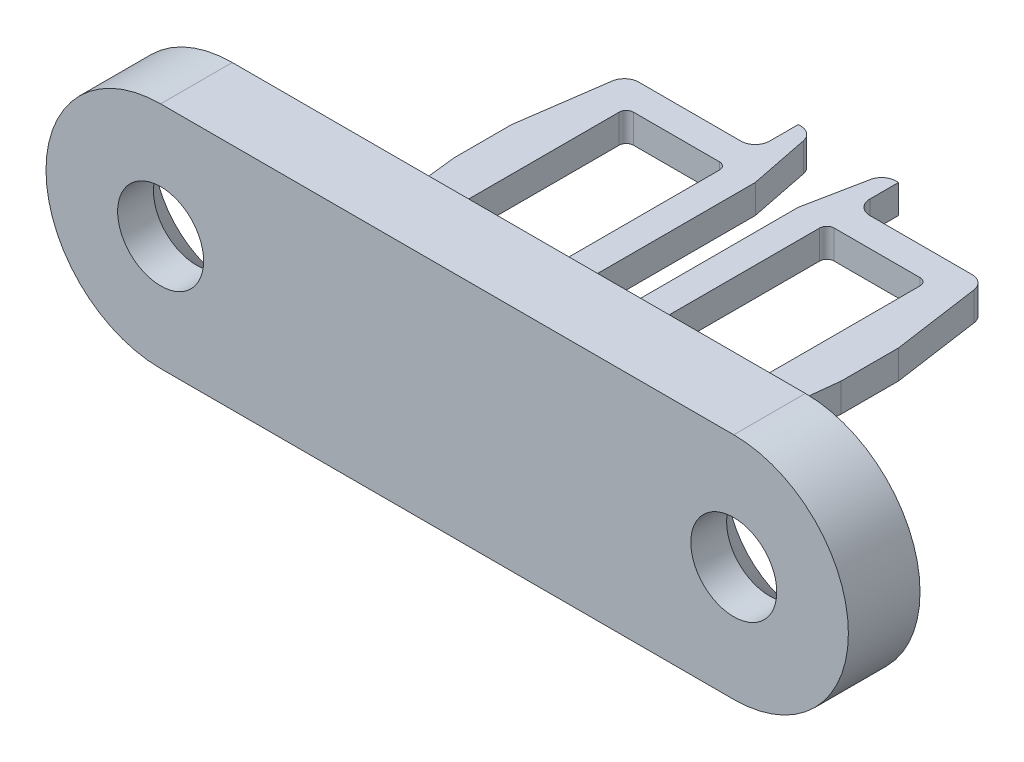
ISO-10303-21;
HEADER;
FILE_DESCRIPTION(('STEP AP214'),'2;1');
FILE_NAME('part.step','',(''),(''),'','','');
FILE_SCHEMA(('AUTOMOTIVE_DESIGN { 1 0 10303 214 1 1 1 1 }'));
ENDSEC;
DATA;
#1=APPLICATION_CONTEXT('core data for automotive mechanical design processes');
#2=APPLICATION_PROTOCOL_DEFINITION('international standard','automotive_design',2000,#1);
#3=PRODUCT_CONTEXT('',#1,'mechanical');
#4=PRODUCT('Part','Part','',(#3));
#5=PRODUCT_RELATED_PRODUCT_CATEGORY('part','',(#4));
#6=PRODUCT_DEFINITION_FORMATION('','',#4);
#7=PRODUCT_DEFINITION_CONTEXT('part definition',#1,'design');
#8=PRODUCT_DEFINITION('design','',#6,#7);
#9=PRODUCT_DEFINITION_SHAPE('','',#8);
#10=(LENGTH_UNIT() NAMED_UNIT(*) SI_UNIT(.MILLI.,.METRE.));
#11=(NAMED_UNIT(*) PLANE_ANGLE_UNIT() SI_UNIT($,.RADIAN.));
#12=(NAMED_UNIT(*) SI_UNIT($,.STERADIAN.) SOLID_ANGLE_UNIT());
#13=UNCERTAINTY_MEASURE_WITH_UNIT(LENGTH_MEASURE(1.E-05),#10,'distance_accuracy_value','');
#14=(GEOMETRIC_REPRESENTATION_CONTEXT(3) GLOBAL_UNCERTAINTY_ASSIGNED_CONTEXT((#13)) GLOBAL_UNIT_ASSIGNED_CONTEXT((#10,
#11,#12)) REPRESENTATION_CONTEXT('',''));
#15=CARTESIAN_POINT('',(0.,0.,0.));
#16=DIRECTION('',(0.,0.,1.));
#17=DIRECTION('',(1.,0.,0.));
#18=AXIS2_PLACEMENT_3D('',#15,#16,#17);
#19=CARTESIAN_POINT('',(3.3198039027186,1.,-27.));
#20=DIRECTION('',(0.,-1.,0.));
#21=DIRECTION('',(0.,0.,-1.));
#22=AXIS2_PLACEMENT_3D('',#19,#20,#21);
#23=CYLINDRICAL_SURFACE('',#22,1.00000000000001);
#24=CARTESIAN_POINT('',(3.3198039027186,1.,-27.));
#25=DIRECTION('',(0.,-1.,0.));
#26=DIRECTION('',(0.,0.,-1.));
#27=AXIS2_PLACEMENT_3D('',#24,#25,#26);
#28=CIRCLE('',#27,1.00000000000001);
#29=CARTESIAN_POINT('',(2.33922322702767,1.,-27.1961161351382));
#30=VERTEX_POINT('',#29);
#31=CARTESIAN_POINT('',(3.3198039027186,1.,-28.));
#32=VERTEX_POINT('',#31);
#33=EDGE_CURVE('E263',#30,#32,#28,.T.);
#34=ORIENTED_EDGE('',*,*,#33,.T.);
#35=DIRECTION('',(0.,1.,0.));
#36=VECTOR('',#35,1.);
#37=CARTESIAN_POINT('',(3.3198039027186,1.,-28.));
#38=LINE('',#37,#36);
#39=CARTESIAN_POINT('',(3.3198039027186,-1.,-28.));
#40=VERTEX_POINT('',#39);
#41=EDGE_CURVE('E265',#40,#32,#38,.T.);
#42=ORIENTED_EDGE('',*,*,#41,.F.);
#43=CARTESIAN_POINT('',(3.3198039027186,-1.,-27.));
#44=DIRECTION('',(0.,-1.,0.));
#45=DIRECTION('',(0.,0.,-1.));
#46=AXIS2_PLACEMENT_3D('',#43,#44,#45);
#47=CIRCLE('',#46,1.00000000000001);
#48=CARTESIAN_POINT('',(2.33922322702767,-1.,-27.1961161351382));
#49=VERTEX_POINT('',#48);
#50=EDGE_CURVE('E19',#40,#49,#47,.F.);
#51=ORIENTED_EDGE('',*,*,#50,.T.);
#52=DIRECTION('',(0.,1.,0.));
#53=VECTOR('',#52,1.);
#54=CARTESIAN_POINT('',(2.33922322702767,1.,-27.1961161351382));
#55=LINE('',#54,#53);
#56=EDGE_CURVE('E331',#30,#49,#55,.F.);
#57=ORIENTED_EDGE('',*,*,#56,.F.);
#58=EDGE_LOOP('',(#34,#42,#51,#57));
#59=FACE_BOUND('',#58,.T.);
#60=ADVANCED_FACE('F16',(#59),#23,.T.);
#61=CARTESIAN_POINT('',(-3.31980390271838,1.,-27.));
#62=DIRECTION('',(0.,-1.,0.));
#63=DIRECTION('',(0.,0.,-1.));
#64=AXIS2_PLACEMENT_3D('',#61,#62,#63);
#65=CYLINDRICAL_SURFACE('',#64,1.00000000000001);
#66=CARTESIAN_POINT('',(-3.31980390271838,1.,-27.));
#67=DIRECTION('',(0.,-1.,0.));
#68=DIRECTION('',(0.,0.,-1.));
#69=AXIS2_PLACEMENT_3D('',#66,#67,#68);
#70=CIRCLE('',#69,1.00000000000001);
#71=CARTESIAN_POINT('',(-3.31980390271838,1.,-28.));
#72=VERTEX_POINT('',#71);
#73=CARTESIAN_POINT('',(-2.33922322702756,1.,-27.1961161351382));
#74=VERTEX_POINT('',#73);
#75=EDGE_CURVE('E291',#72,#74,#70,.T.);
#76=ORIENTED_EDGE('',*,*,#75,.T.);
#77=DIRECTION('',(0.,1.,0.));
#78=VECTOR('',#77,1.);
#79=CARTESIAN_POINT('',(-2.33922322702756,1.,-27.1961161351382));
#80=LINE('',#79,#78);
#81=CARTESIAN_POINT('',(-2.33922322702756,-1.,-27.1961161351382));
#82=VERTEX_POINT('',#81);
#83=EDGE_CURVE('E381',#82,#74,#80,.T.);
#84=ORIENTED_EDGE('',*,*,#83,.F.);
#85=CARTESIAN_POINT('',(-3.31980390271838,-1.,-27.));
#86=DIRECTION('',(0.,-1.,0.));
#87=DIRECTION('',(0.,0.,-1.));
#88=AXIS2_PLACEMENT_3D('',#85,#86,#87);
#89=CIRCLE('',#88,1.00000000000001);
#90=CARTESIAN_POINT('',(-3.31980390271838,-1.,-28.));
#91=VERTEX_POINT('',#90);
#92=EDGE_CURVE('E374',#82,#91,#89,.F.);
#93=ORIENTED_EDGE('',*,*,#92,.T.);
#94=DIRECTION('',(0.,1.,0.));
#95=VECTOR('',#94,1.);
#96=CARTESIAN_POINT('',(-3.31980390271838,1.,-28.));
#97=LINE('',#96,#95);
#98=EDGE_CURVE('E288',#72,#91,#97,.F.);
#99=ORIENTED_EDGE('',*,*,#98,.F.);
#100=EDGE_LOOP('',(#76,#84,#93,#99));
#101=FACE_BOUND('',#100,.T.);
#102=ADVANCED_FACE('F379',(#101),#65,.T.);
#103=CARTESIAN_POINT('',(-3.31980390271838,1.,-28.));
#104=DIRECTION('',(0.,0.,-1.));
#105=DIRECTION('',(-1.,0.,0.));
#106=AXIS2_PLACEMENT_3D('',#103,#104,#105);
#107=PLANE('',#106);
#108=DIRECTION('',(-1.,0.,0.));
#109=VECTOR('',#108,1.);
#110=CARTESIAN_POINT('',(-3.31980390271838,1.,-28.));
#111=LINE('',#110,#109);
#112=CARTESIAN_POINT('',(-3.5,1.,-28.));
#113=VERTEX_POINT('',#112);
#114=EDGE_CURVE('E285',#113,#72,#111,.F.);
#115=ORIENTED_EDGE('',*,*,#114,.T.);
#116=ORIENTED_EDGE('',*,*,#98,.T.);
#117=DIRECTION('',(-1.,0.,0.));
#118=VECTOR('',#117,1.);
#119=CARTESIAN_POINT('',(-3.31980390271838,-1.,-28.));
#120=LINE('',#119,#118);
#121=CARTESIAN_POINT('',(-3.5,-1.,-28.));
#122=VERTEX_POINT('',#121);
#123=EDGE_CURVE('E289',#91,#122,#120,.T.);
#124=ORIENTED_EDGE('',*,*,#123,.T.);
#125=DIRECTION('',(0.,1.,0.));
#126=VECTOR('',#125,1.);
#127=CARTESIAN_POINT('',(-3.5,1.,-28.));
#128=LINE('',#127,#126);
#129=EDGE_CURVE('E389',#113,#122,#128,.F.);
#130=ORIENTED_EDGE('',*,*,#129,.F.);
#131=EDGE_LOOP('',(#115,#116,#124,#130));
#132=FACE_BOUND('',#131,.T.);
#133=ADVANCED_FACE('F385',(#132),#107,.T.);
#134=CARTESIAN_POINT('',(-4.5,1.,-26.));
#135=DIRECTION('',(0.,-1.,0.));
#136=DIRECTION('',(0.,0.,-1.));
#137=AXIS2_PLACEMENT_3D('',#134,#135,#136);
#138=CYLINDRICAL_SURFACE('',#137,1.);
#139=DIRECTION('',(0.,1.,0.));
#140=VECTOR('',#139,1.);
#141=CARTESIAN_POINT('',(-4.5,1.,-25.));
#142=LINE('',#141,#140);
#143=CARTESIAN_POINT('',(-4.5,1.,-25.));
#144=VERTEX_POINT('',#143);
#145=CARTESIAN_POINT('',(-4.5,-1.,-25.));
#146=VERTEX_POINT('',#145);
#147=EDGE_CURVE('E646',#144,#146,#142,.F.);
#148=ORIENTED_EDGE('',*,*,#147,.F.);
#149=CARTESIAN_POINT('',(-4.5,1.,-26.));
#150=DIRECTION('',(0.,-1.,0.));
#151=DIRECTION('',(0.,0.,-1.));
#152=AXIS2_PLACEMENT_3D('',#149,#150,#151);
#153=CIRCLE('',#152,1.);
#154=CARTESIAN_POINT('',(-3.5,1.,-26.));
#155=VERTEX_POINT('',#154);
#156=EDGE_CURVE('E294',#155,#144,#153,.T.);
#157=ORIENTED_EDGE('',*,*,#156,.F.);
#158=DIRECTION('',(0.,1.,0.));
#159=VECTOR('',#158,1.);
#160=CARTESIAN_POINT('',(-3.5,1.,-26.));
#161=LINE('',#160,#159);
#162=CARTESIAN_POINT('',(-3.5,-1.,-26.));
#163=VERTEX_POINT('',#162);
#164=EDGE_CURVE('E655',#163,#155,#161,.T.);
#165=ORIENTED_EDGE('',*,*,#164,.F.);
#166=CARTESIAN_POINT('',(-4.5,-1.,-26.));
#167=DIRECTION('',(0.,-1.,0.));
#168=DIRECTION('',(0.,0.,-1.));
#169=AXIS2_PLACEMENT_3D('',#166,#167,#168);
#170=CIRCLE('',#169,1.);
#171=EDGE_CURVE('E370',#146,#163,#170,.F.);
#172=ORIENTED_EDGE('',*,*,#171,.F.);
#173=EDGE_LOOP('',(#148,#157,#165,#172));
#174=FACE_BOUND('',#173,.T.);
#175=ADVANCED_FACE('F842',(#174),#138,.F.);
#176=CARTESIAN_POINT('',(-11.6327045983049,1.,-24.));
#177=DIRECTION('',(0.,-1.,0.));
#178=DIRECTION('',(0.,0.,-1.));
#179=AXIS2_PLACEMENT_3D('',#176,#177,#178);
#180=CYLINDRICAL_SURFACE('',#179,1.00000000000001);
#181=CARTESIAN_POINT('',(-11.6327045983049,1.,-24.));
#182=DIRECTION('',(0.,-1.,0.));
#183=DIRECTION('',(0.,0.,-1.));
#184=AXIS2_PLACEMENT_3D('',#181,#182,#183);
#185=CIRCLE('',#184,1.00000000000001);
#186=CARTESIAN_POINT('',(-12.6226540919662,1.,-24.1414213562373));
#187=VERTEX_POINT('',#186);
#188=CARTESIAN_POINT('',(-11.6327045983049,1.,-25.));
#189=VERTEX_POINT('',#188);
#190=EDGE_CURVE('E366',#187,#189,#185,.T.);
#191=ORIENTED_EDGE('',*,*,#190,.T.);
#192=DIRECTION('',(0.,1.,0.));
#193=VECTOR('',#192,1.);
#194=CARTESIAN_POINT('',(-11.6327045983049,1.,-25.));
#195=LINE('',#194,#193);
#196=CARTESIAN_POINT('',(-11.6327045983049,-1.,-25.));
#197=VERTEX_POINT('',#196);
#198=EDGE_CURVE('E652',#197,#189,#195,.T.);
#199=ORIENTED_EDGE('',*,*,#198,.F.);
#200=CARTESIAN_POINT('',(-11.6327045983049,-1.,-24.));
#201=DIRECTION('',(0.,-1.,0.));
#202=DIRECTION('',(0.,0.,-1.));
#203=AXIS2_PLACEMENT_3D('',#200,#201,#202);
#204=CIRCLE('',#203,1.00000000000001);
#205=CARTESIAN_POINT('',(-12.6226540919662,-1.,-24.1414213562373));
#206=VERTEX_POINT('',#205);
#207=EDGE_CURVE('E368',#197,#206,#204,.F.);
#208=ORIENTED_EDGE('',*,*,#207,.T.);
#209=DIRECTION('',(0.,1.,0.));
#210=VECTOR('',#209,1.);
#211=CARTESIAN_POINT('',(-12.6226540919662,1.,-24.1414213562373));
#212=LINE('',#211,#210);
#213=EDGE_CURVE('E643',#187,#206,#212,.F.);
#214=ORIENTED_EDGE('',*,*,#213,.F.);
#215=EDGE_LOOP('',(#191,#199,#208,#214));
#216=FACE_BOUND('',#215,.T.);
#217=ADVANCED_FACE('F839',(#216),#180,.T.);
#218=CARTESIAN_POINT('',(11.6327045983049,1.,-24.));
#219=DIRECTION('',(0.,-1.,0.));
#220=DIRECTION('',(0.,0.,-1.));
#221=AXIS2_PLACEMENT_3D('',#218,#219,#220);
#222=CYLINDRICAL_SURFACE('',#221,1.00000000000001);
#223=CARTESIAN_POINT('',(11.6327045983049,1.,-24.));
#224=DIRECTION('',(0.,-1.,0.));
#225=DIRECTION('',(0.,0.,-1.));
#226=AXIS2_PLACEMENT_3D('',#223,#224,#225);
#227=CIRCLE('',#226,1.00000000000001);
#228=CARTESIAN_POINT('',(11.6327045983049,1.,-25.));
#229=VERTEX_POINT('',#228);
#230=CARTESIAN_POINT('',(12.6226540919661,1.,-24.1414213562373));
#231=VERTEX_POINT('',#230);
#232=EDGE_CURVE('E275',#229,#231,#227,.T.);
#233=ORIENTED_EDGE('',*,*,#232,.T.);
#234=DIRECTION('',(0.,1.,0.));
#235=VECTOR('',#234,1.);
#236=CARTESIAN_POINT('',(12.6226540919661,1.,-24.1414213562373));
#237=LINE('',#236,#235);
#238=CARTESIAN_POINT('',(12.6226540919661,-1.,-24.1414213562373));
#239=VERTEX_POINT('',#238);
#240=EDGE_CURVE('E636',#239,#231,#237,.T.);
#241=ORIENTED_EDGE('',*,*,#240,.F.);
#242=CARTESIAN_POINT('',(11.6327045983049,-1.,-24.));
#243=DIRECTION('',(0.,-1.,0.));
#244=DIRECTION('',(0.,0.,-1.));
#245=AXIS2_PLACEMENT_3D('',#242,#243,#244);
#246=CIRCLE('',#245,1.00000000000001);
#247=CARTESIAN_POINT('',(11.6327045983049,-1.,-25.));
#248=VERTEX_POINT('',#247);
#249=EDGE_CURVE('E277',#239,#248,#246,.F.);
#250=ORIENTED_EDGE('',*,*,#249,.T.);
#251=DIRECTION('',(0.,1.,0.));
#252=VECTOR('',#251,1.);
#253=CARTESIAN_POINT('',(11.6327045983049,1.,-25.));
#254=LINE('',#253,#252);
#255=EDGE_CURVE('E630',#229,#248,#254,.F.);
#256=ORIENTED_EDGE('',*,*,#255,.F.);
#257=EDGE_LOOP('',(#233,#241,#250,#256));
#258=FACE_BOUND('',#257,.T.);
#259=ADVANCED_FACE('F683',(#258),#222,.T.);
#260=CARTESIAN_POINT('',(3.5,1.,-28.));
#261=DIRECTION('',(0.,0.,-1.));
#262=DIRECTION('',(-1.,0.,0.));
#263=AXIS2_PLACEMENT_3D('',#260,#261,#262);
#264=PLANE('',#263);
#265=DIRECTION('',(-1.,0.,0.));
#266=VECTOR('',#265,1.);
#267=CARTESIAN_POINT('',(3.5,1.,-28.));
#268=LINE('',#267,#266);
#269=CARTESIAN_POINT('',(3.49999999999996,1.,-28.));
#270=VERTEX_POINT('',#269);
#271=EDGE_CURVE('E269',#32,#270,#268,.F.);
#272=ORIENTED_EDGE('',*,*,#271,.T.);
#273=DIRECTION('',(0.,1.,0.));
#274=VECTOR('',#273,1.);
#275=CARTESIAN_POINT('',(3.49999999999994,1.,-28.));
#276=LINE('',#275,#274);
#277=CARTESIAN_POINT('',(3.49999999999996,-1.,-28.));
#278=VERTEX_POINT('',#277);
#279=EDGE_CURVE('E273',#278,#270,#276,.T.);
#280=ORIENTED_EDGE('',*,*,#279,.F.);
#281=DIRECTION('',(-1.,0.,0.));
#282=VECTOR('',#281,1.);
#283=CARTESIAN_POINT('',(3.5,-1.,-28.));
#284=LINE('',#283,#282);
#285=EDGE_CURVE('E255',#278,#40,#284,.T.);
#286=ORIENTED_EDGE('',*,*,#285,.T.);
#287=ORIENTED_EDGE('',*,*,#41,.T.);
#288=EDGE_LOOP('',(#272,#280,#286,#287));
#289=FACE_BOUND('',#288,.T.);
#290=ADVANCED_FACE('F271',(#289),#264,.T.);
#291=CARTESIAN_POINT('',(4.49999999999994,1.,-26.));
#292=DIRECTION('',(0.,-1.,0.));
#293=DIRECTION('',(0.,0.,-1.));
#294=AXIS2_PLACEMENT_3D('',#291,#292,#293);
#295=CYLINDRICAL_SURFACE('',#294,0.999999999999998);
#296=DIRECTION('',(0.,1.,0.));
#297=VECTOR('',#296,1.);
#298=CARTESIAN_POINT('',(3.49999999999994,1.,-26.));
#299=LINE('',#298,#297);
#300=CARTESIAN_POINT('',(3.49999999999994,1.,-26.));
#301=VERTEX_POINT('',#300);
#302=CARTESIAN_POINT('',(3.49999999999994,-1.,-26.));
#303=VERTEX_POINT('',#302);
#304=EDGE_CURVE('E624',#301,#303,#299,.F.);
#305=ORIENTED_EDGE('',*,*,#304,.F.);
#306=CARTESIAN_POINT('',(4.49999999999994,1.,-26.));
#307=DIRECTION('',(0.,-1.,0.));
#308=DIRECTION('',(0.,0.,-1.));
#309=AXIS2_PLACEMENT_3D('',#306,#307,#308);
#310=CIRCLE('',#309,0.999999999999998);
#311=CARTESIAN_POINT('',(4.49999999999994,1.,-25.));
#312=VERTEX_POINT('',#311);
#313=EDGE_CURVE('E284',#312,#301,#310,.T.);
#314=ORIENTED_EDGE('',*,*,#313,.F.);
#315=DIRECTION('',(0.,1.,0.));
#316=VECTOR('',#315,1.);
#317=CARTESIAN_POINT('',(4.49999999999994,1.,-25.));
#318=LINE('',#317,#316);
#319=CARTESIAN_POINT('',(4.49999999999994,-1.,-25.));
#320=VERTEX_POINT('',#319);
#321=EDGE_CURVE('E633',#320,#312,#318,.T.);
#322=ORIENTED_EDGE('',*,*,#321,.F.);
#323=CARTESIAN_POINT('',(4.49999999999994,-1.,-26.));
#324=DIRECTION('',(0.,-1.,0.));
#325=DIRECTION('',(0.,0.,-1.));
#326=AXIS2_PLACEMENT_3D('',#323,#324,#325);
#327=CIRCLE('',#326,0.999999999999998);
#328=EDGE_CURVE('E362',#303,#320,#327,.F.);
#329=ORIENTED_EDGE('',*,*,#328,.F.);
#330=EDGE_LOOP('',(#305,#314,#322,#329));
#331=FACE_BOUND('',#330,.T.);
#332=ADVANCED_FACE('F692',(#331),#295,.F.);
#333=CARTESIAN_POINT('',(10.,1.,-9.49999999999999));
#334=DIRECTION('',(0.,-1.,0.));
#335=DIRECTION('',(0.,0.,-1.));
#336=AXIS2_PLACEMENT_3D('',#333,#334,#335);
#337=CYLINDRICAL_SURFACE('',#336,0.5);
#338=DIRECTION('',(0.,1.,0.));
#339=VECTOR('',#338,1.);
#340=CARTESIAN_POINT('',(10.,1.,-9.));
#341=LINE('',#340,#339);
#342=CARTESIAN_POINT('',(10.,-1.,-8.99999999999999));
#343=VERTEX_POINT('',#342);
#344=CARTESIAN_POINT('',(10.,1.,-8.99999999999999));
#345=VERTEX_POINT('',#344);
#346=EDGE_CURVE('E615',#343,#345,#341,.T.);
#347=ORIENTED_EDGE('',*,*,#346,.T.);
#348=CARTESIAN_POINT('',(10.,1.,-9.49999999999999));
#349=DIRECTION('',(0.,-1.,0.));
#350=DIRECTION('',(0.,0.,-1.));
#351=AXIS2_PLACEMENT_3D('',#348,#349,#350);
#352=CIRCLE('',#351,0.5);
#353=CARTESIAN_POINT('',(10.5,1.,-9.49999999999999));
#354=VERTEX_POINT('',#353);
#355=EDGE_CURVE('E360',#354,#345,#352,.T.);
#356=ORIENTED_EDGE('',*,*,#355,.F.);
#357=DIRECTION('',(0.,1.,0.));
#358=VECTOR('',#357,1.);
#359=CARTESIAN_POINT('',(10.5,1.,-9.49999999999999));
#360=LINE('',#359,#358);
#361=CARTESIAN_POINT('',(10.5,-1.,-9.49999999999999));
#362=VERTEX_POINT('',#361);
#363=EDGE_CURVE('E618',#354,#362,#360,.F.);
#364=ORIENTED_EDGE('',*,*,#363,.T.);
#365=CARTESIAN_POINT('',(10.,-1.,-9.49999999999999));
#366=DIRECTION('',(0.,-1.,0.));
#367=DIRECTION('',(0.,0.,-1.));
#368=AXIS2_PLACEMENT_3D('',#365,#366,#367);
#369=CIRCLE('',#368,0.5);
#370=EDGE_CURVE('E358',#343,#362,#369,.F.);
#371=ORIENTED_EDGE('',*,*,#370,.F.);
#372=EDGE_LOOP('',(#347,#356,#364,#371));
#373=FACE_BOUND('',#372,.T.);
#374=ADVANCED_FACE('F799',(#373),#337,.F.);
#375=CARTESIAN_POINT('',(4.00000000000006,1.,-9.5));
#376=DIRECTION('',(0.,-1.,0.));
#377=DIRECTION('',(0.,0.,-1.));
#378=AXIS2_PLACEMENT_3D('',#375,#376,#377);
#379=CYLINDRICAL_SURFACE('',#378,0.500000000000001);
#380=DIRECTION('',(0.,1.,0.));
#381=VECTOR('',#380,1.);
#382=CARTESIAN_POINT('',(3.50000000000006,1.,-9.5));
#383=LINE('',#382,#381);
#384=CARTESIAN_POINT('',(3.50000000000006,-1.,-9.5));
#385=VERTEX_POINT('',#384);
#386=CARTESIAN_POINT('',(3.50000000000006,1.,-9.5));
#387=VERTEX_POINT('',#386);
#388=EDGE_CURVE('E609',#385,#387,#383,.T.);
#389=ORIENTED_EDGE('',*,*,#388,.T.);
#390=CARTESIAN_POINT('',(4.00000000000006,1.,-9.5));
#391=DIRECTION('',(0.,-1.,0.));
#392=DIRECTION('',(0.,0.,-1.));
#393=AXIS2_PLACEMENT_3D('',#390,#391,#392);
#394=CIRCLE('',#393,0.500000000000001);
#395=CARTESIAN_POINT('',(4.00000000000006,1.,-8.99999999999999));
#396=VERTEX_POINT('',#395);
#397=EDGE_CURVE('E356',#396,#387,#394,.T.);
#398=ORIENTED_EDGE('',*,*,#397,.F.);
#399=DIRECTION('',(0.,1.,0.));
#400=VECTOR('',#399,1.);
#401=CARTESIAN_POINT('',(4.00000000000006,1.,-9.));
#402=LINE('',#401,#400);
#403=CARTESIAN_POINT('',(4.00000000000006,-1.,-8.99999999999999));
#404=VERTEX_POINT('',#403);
#405=EDGE_CURVE('E612',#396,#404,#402,.F.);
#406=ORIENTED_EDGE('',*,*,#405,.T.);
#407=CARTESIAN_POINT('',(4.00000000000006,-1.,-9.5));
#408=DIRECTION('',(0.,-1.,0.));
#409=DIRECTION('',(0.,0.,-1.));
#410=AXIS2_PLACEMENT_3D('',#407,#408,#409);
#411=CIRCLE('',#410,0.500000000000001);
#412=EDGE_CURVE('E354',#385,#404,#411,.F.);
#413=ORIENTED_EDGE('',*,*,#412,.F.);
#414=EDGE_LOOP('',(#389,#398,#406,#413));
#415=FACE_BOUND('',#414,.T.);
#416=ADVANCED_FACE('F804',(#415),#379,.F.);
#417=CARTESIAN_POINT('',(4.00000000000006,1.,-22.5));
#418=DIRECTION('',(0.,-1.,0.));
#419=DIRECTION('',(0.,0.,-1.));
#420=AXIS2_PLACEMENT_3D('',#417,#418,#419);
#421=CYLINDRICAL_SURFACE('',#420,0.5);
#422=DIRECTION('',(0.,1.,0.));
#423=VECTOR('',#422,1.);
#424=CARTESIAN_POINT('',(4.00000000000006,1.,-23.));
#425=LINE('',#424,#423);
#426=CARTESIAN_POINT('',(4.00000000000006,-1.,-23.));
#427=VERTEX_POINT('',#426);
#428=CARTESIAN_POINT('',(4.00000000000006,1.,-23.));
#429=VERTEX_POINT('',#428);
#430=EDGE_CURVE('E603',#427,#429,#425,.T.);
#431=ORIENTED_EDGE('',*,*,#430,.T.);
#432=CARTESIAN_POINT('',(4.00000000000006,1.,-22.5));
#433=DIRECTION('',(0.,-1.,0.));
#434=DIRECTION('',(0.,0.,-1.));
#435=AXIS2_PLACEMENT_3D('',#432,#433,#434);
#436=CIRCLE('',#435,0.5);
#437=CARTESIAN_POINT('',(3.50000000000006,1.,-22.5));
#438=VERTEX_POINT('',#437);
#439=EDGE_CURVE('E352',#438,#429,#436,.T.);
#440=ORIENTED_EDGE('',*,*,#439,.F.);
#441=DIRECTION('',(0.,1.,0.));
#442=VECTOR('',#441,1.);
#443=CARTESIAN_POINT('',(3.50000000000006,1.,-22.5));
#444=LINE('',#443,#442);
#445=CARTESIAN_POINT('',(3.50000000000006,-1.,-22.5));
#446=VERTEX_POINT('',#445);
#447=EDGE_CURVE('E606',#438,#446,#444,.F.);
#448=ORIENTED_EDGE('',*,*,#447,.T.);
#449=CARTESIAN_POINT('',(4.00000000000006,-1.,-22.5));
#450=DIRECTION('',(0.,-1.,0.));
#451=DIRECTION('',(0.,0.,-1.));
#452=AXIS2_PLACEMENT_3D('',#449,#450,#451);
#453=CIRCLE('',#452,0.5);
#454=EDGE_CURVE('E350',#427,#446,#453,.F.);
#455=ORIENTED_EDGE('',*,*,#454,.F.);
#456=EDGE_LOOP('',(#431,#440,#448,#455));
#457=FACE_BOUND('',#456,.T.);
#458=ADVANCED_FACE('F810',(#457),#421,.F.);
#459=CARTESIAN_POINT('',(10.0000000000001,1.,-22.5));
#460=DIRECTION('',(0.,-1.,0.));
#461=DIRECTION('',(0.,0.,-1.));
#462=AXIS2_PLACEMENT_3D('',#459,#460,#461);
#463=CYLINDRICAL_SURFACE('',#462,0.5);
#464=DIRECTION('',(0.,1.,0.));
#465=VECTOR('',#464,1.);
#466=CARTESIAN_POINT('',(10.5,1.,-22.5));
#467=LINE('',#466,#465);
#468=CARTESIAN_POINT('',(10.5,-1.,-22.5));
#469=VERTEX_POINT('',#468);
#470=CARTESIAN_POINT('',(10.5,1.,-22.5));
#471=VERTEX_POINT('',#470);
#472=EDGE_CURVE('E621',#469,#471,#467,.T.);
#473=ORIENTED_EDGE('',*,*,#472,.T.);
#474=CARTESIAN_POINT('',(10.0000000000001,1.,-22.5));
#475=DIRECTION('',(0.,-1.,0.));
#476=DIRECTION('',(0.,0.,-1.));
#477=AXIS2_PLACEMENT_3D('',#474,#475,#476);
#478=CIRCLE('',#477,0.5);
#479=CARTESIAN_POINT('',(10.0000000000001,1.,-23.));
#480=VERTEX_POINT('',#479);
#481=EDGE_CURVE('E348',#480,#471,#478,.T.);
#482=ORIENTED_EDGE('',*,*,#481,.F.);
#483=DIRECTION('',(0.,1.,0.));
#484=VECTOR('',#483,1.);
#485=CARTESIAN_POINT('',(10.0000000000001,1.,-23.));
#486=LINE('',#485,#484);
#487=CARTESIAN_POINT('',(10.0000000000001,-1.,-23.));
#488=VERTEX_POINT('',#487);
#489=EDGE_CURVE('E600',#480,#488,#486,.F.);
#490=ORIENTED_EDGE('',*,*,#489,.T.);
#491=CARTESIAN_POINT('',(10.0000000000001,-1.,-22.5));
#492=DIRECTION('',(0.,-1.,0.));
#493=DIRECTION('',(0.,0.,-1.));
#494=AXIS2_PLACEMENT_3D('',#491,#492,#493);
#495=CIRCLE('',#494,0.5);
#496=EDGE_CURVE('E346',#469,#488,#495,.F.);
#497=ORIENTED_EDGE('',*,*,#496,.F.);
#498=EDGE_LOOP('',(#473,#482,#490,#497));
#499=FACE_BOUND('',#498,.T.);
#500=ADVANCED_FACE('F814',(#499),#463,.F.);
#501=CARTESIAN_POINT('',(-4.,1.,-9.5));
#502=DIRECTION('',(0.,-1.,0.));
#503=DIRECTION('',(0.,0.,-1.));
#504=AXIS2_PLACEMENT_3D('',#501,#502,#503);
#505=CYLINDRICAL_SURFACE('',#504,0.5);
#506=DIRECTION('',(0.,1.,0.));
#507=VECTOR('',#506,1.);
#508=CARTESIAN_POINT('',(-4.,1.,-8.99999999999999));
#509=LINE('',#508,#507);
#510=CARTESIAN_POINT('',(-4.,-1.,-8.99999999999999));
#511=VERTEX_POINT('',#510);
#512=CARTESIAN_POINT('',(-4.,1.,-8.99999999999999));
#513=VERTEX_POINT('',#512);
#514=EDGE_CURVE('E591',#511,#513,#509,.T.);
#515=ORIENTED_EDGE('',*,*,#514,.T.);
#516=CARTESIAN_POINT('',(-4.,1.,-9.5));
#517=DIRECTION('',(0.,-1.,0.));
#518=DIRECTION('',(0.,0.,-1.));
#519=AXIS2_PLACEMENT_3D('',#516,#517,#518);
#520=CIRCLE('',#519,0.5);
#521=CARTESIAN_POINT('',(-3.5,1.,-9.5));
#522=VERTEX_POINT('',#521);
#523=EDGE_CURVE('E344',#522,#513,#520,.T.);
#524=ORIENTED_EDGE('',*,*,#523,.F.);
#525=DIRECTION('',(0.,1.,0.));
#526=VECTOR('',#525,1.);
#527=CARTESIAN_POINT('',(-3.5,1.,-9.5));
#528=LINE('',#527,#526);
#529=CARTESIAN_POINT('',(-3.5,-1.,-9.5));
#530=VERTEX_POINT('',#529);
#531=EDGE_CURVE('E594',#522,#530,#528,.F.);
#532=ORIENTED_EDGE('',*,*,#531,.T.);
#533=CARTESIAN_POINT('',(-4.,-1.,-9.5));
#534=DIRECTION('',(0.,-1.,0.));
#535=DIRECTION('',(0.,0.,-1.));
#536=AXIS2_PLACEMENT_3D('',#533,#534,#535);
#537=CIRCLE('',#536,0.5);
#538=EDGE_CURVE('E342',#511,#530,#537,.F.);
#539=ORIENTED_EDGE('',*,*,#538,.F.);
#540=EDGE_LOOP('',(#515,#524,#532,#539));
#541=FACE_BOUND('',#540,.T.);
#542=ADVANCED_FACE('F817',(#541),#505,.F.);
#543=CARTESIAN_POINT('',(-10.,1.,-9.49999999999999));
#544=DIRECTION('',(0.,-1.,0.));
#545=DIRECTION('',(0.,0.,-1.));
#546=AXIS2_PLACEMENT_3D('',#543,#544,#545);
#547=CYLINDRICAL_SURFACE('',#546,0.5);
#548=DIRECTION('',(0.,1.,0.));
#549=VECTOR('',#548,1.);
#550=CARTESIAN_POINT('',(-10.5,1.,-9.49999999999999));
#551=LINE('',#550,#549);
#552=CARTESIAN_POINT('',(-10.5,-1.,-9.49999999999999));
#553=VERTEX_POINT('',#552);
#554=CARTESIAN_POINT('',(-10.5,1.,-9.49999999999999));
#555=VERTEX_POINT('',#554);
#556=EDGE_CURVE('E585',#553,#555,#551,.T.);
#557=ORIENTED_EDGE('',*,*,#556,.T.);
#558=CARTESIAN_POINT('',(-10.,1.,-9.49999999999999));
#559=DIRECTION('',(0.,-1.,0.));
#560=DIRECTION('',(0.,0.,-1.));
#561=AXIS2_PLACEMENT_3D('',#558,#559,#560);
#562=CIRCLE('',#561,0.5);
#563=CARTESIAN_POINT('',(-10.,1.,-8.99999999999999));
#564=VERTEX_POINT('',#563);
#565=EDGE_CURVE('E340',#564,#555,#562,.T.);
#566=ORIENTED_EDGE('',*,*,#565,.F.);
#567=DIRECTION('',(0.,1.,0.));
#568=VECTOR('',#567,1.);
#569=CARTESIAN_POINT('',(-10.,1.,-8.99999999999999));
#570=LINE('',#569,#568);
#571=CARTESIAN_POINT('',(-10.,-1.,-8.99999999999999));
#572=VERTEX_POINT('',#571);
#573=EDGE_CURVE('E588',#564,#572,#570,.F.);
#574=ORIENTED_EDGE('',*,*,#573,.T.);
#575=CARTESIAN_POINT('',(-10.,-1.,-9.49999999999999));
#576=DIRECTION('',(0.,-1.,0.));
#577=DIRECTION('',(0.,0.,-1.));
#578=AXIS2_PLACEMENT_3D('',#575,#576,#577);
#579=CIRCLE('',#578,0.5);
#580=EDGE_CURVE('E338',#553,#572,#579,.F.);
#581=ORIENTED_EDGE('',*,*,#580,.F.);
#582=EDGE_LOOP('',(#557,#566,#574,#581));
#583=FACE_BOUND('',#582,.T.);
#584=ADVANCED_FACE('F823',(#583),#547,.F.);
#585=CARTESIAN_POINT('',(-10.,1.,-22.5));
#586=DIRECTION('',(0.,-1.,0.));
#587=DIRECTION('',(0.,0.,-1.));
#588=AXIS2_PLACEMENT_3D('',#585,#586,#587);
#589=CYLINDRICAL_SURFACE('',#588,0.5);
#590=DIRECTION('',(0.,1.,0.));
#591=VECTOR('',#590,1.);
#592=CARTESIAN_POINT('',(-10.,1.,-23.));
#593=LINE('',#592,#591);
#594=CARTESIAN_POINT('',(-10.,-1.,-23.));
#595=VERTEX_POINT('',#594);
#596=CARTESIAN_POINT('',(-10.,1.,-23.));
#597=VERTEX_POINT('',#596);
#598=EDGE_CURVE('E578',#595,#597,#593,.T.);
#599=ORIENTED_EDGE('',*,*,#598,.T.);
#600=CARTESIAN_POINT('',(-10.,1.,-22.5));
#601=DIRECTION('',(0.,-1.,0.));
#602=DIRECTION('',(0.,0.,-1.));
#603=AXIS2_PLACEMENT_3D('',#600,#601,#602);
#604=CIRCLE('',#603,0.5);
#605=CARTESIAN_POINT('',(-10.5,1.,-22.5));
#606=VERTEX_POINT('',#605);
#607=EDGE_CURVE('E336',#606,#597,#604,.T.);
#608=ORIENTED_EDGE('',*,*,#607,.F.);
#609=DIRECTION('',(0.,1.,0.));
#610=VECTOR('',#609,1.);
#611=CARTESIAN_POINT('',(-10.5,1.,-22.5));
#612=LINE('',#611,#610);
#613=CARTESIAN_POINT('',(-10.5,-1.,-22.5));
#614=VERTEX_POINT('',#613);
#615=EDGE_CURVE('E582',#606,#614,#612,.F.);
#616=ORIENTED_EDGE('',*,*,#615,.T.);
#617=CARTESIAN_POINT('',(-10.,-1.,-22.5));
#618=DIRECTION('',(0.,-1.,0.));
#619=DIRECTION('',(0.,0.,-1.));
#620=AXIS2_PLACEMENT_3D('',#617,#618,#619);
#621=CIRCLE('',#620,0.5);
#622=EDGE_CURVE('E334',#595,#614,#621,.F.);
#623=ORIENTED_EDGE('',*,*,#622,.F.);
#624=EDGE_LOOP('',(#599,#608,#616,#623));
#625=FACE_BOUND('',#624,.T.);
#626=ADVANCED_FACE('F910',(#625),#589,.F.);
#627=CARTESIAN_POINT('',(-4.,1.,-22.5));
#628=DIRECTION('',(0.,-1.,0.));
#629=DIRECTION('',(0.,0.,-1.));
#630=AXIS2_PLACEMENT_3D('',#627,#628,#629);
#631=CYLINDRICAL_SURFACE('',#630,0.5);
#632=DIRECTION('',(0.,1.,0.));
#633=VECTOR('',#632,1.);
#634=CARTESIAN_POINT('',(-3.5,1.,-22.5));
#635=LINE('',#634,#633);
#636=CARTESIAN_POINT('',(-3.5,-1.,-22.5));
#637=VERTEX_POINT('',#636);
#638=CARTESIAN_POINT('',(-3.5,1.,-22.5));
#639=VERTEX_POINT('',#638);
#640=EDGE_CURVE('E597',#637,#639,#635,.T.);
#641=ORIENTED_EDGE('',*,*,#640,.T.);
#642=CARTESIAN_POINT('',(-4.,1.,-22.5));
#643=DIRECTION('',(0.,-1.,0.));
#644=DIRECTION('',(0.,0.,-1.));
#645=AXIS2_PLACEMENT_3D('',#642,#643,#644);
#646=CIRCLE('',#645,0.5);
#647=CARTESIAN_POINT('',(-4.,1.,-23.));
#648=VERTEX_POINT('',#647);
#649=EDGE_CURVE('E332',#648,#639,#646,.T.);
#650=ORIENTED_EDGE('',*,*,#649,.F.);
#651=DIRECTION('',(0.,1.,0.));
#652=VECTOR('',#651,1.);
#653=CARTESIAN_POINT('',(-4.,1.,-23.));
#654=LINE('',#653,#652);
#655=CARTESIAN_POINT('',(-4.,-1.,-23.));
#656=VERTEX_POINT('',#655);
#657=EDGE_CURVE('E581',#648,#656,#654,.F.);
#658=ORIENTED_EDGE('',*,*,#657,.T.);
#659=CARTESIAN_POINT('',(-4.,-1.,-22.5));
#660=DIRECTION('',(0.,-1.,0.));
#661=DIRECTION('',(0.,0.,-1.));
#662=AXIS2_PLACEMENT_3D('',#659,#660,#661);
#663=CIRCLE('',#662,0.5);
#664=EDGE_CURVE('E329',#637,#656,#663,.F.);
#665=ORIENTED_EDGE('',*,*,#664,.F.);
#666=EDGE_LOOP('',(#641,#650,#658,#665));
#667=FACE_BOUND('',#666,.T.);
#668=ADVANCED_FACE('F917',(#667),#631,.F.);
#669=CARTESIAN_POINT('',(2.33922322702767,1.,-27.1961161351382));
#670=DIRECTION('',(-0.980580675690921,0.,-0.19611613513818));
#671=DIRECTION('',(-0.19611613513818,0.,0.980580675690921));
#672=AXIS2_PLACEMENT_3D('',#669,#670,#671);
#673=PLANE('',#672);
#674=DIRECTION('',(-0.19611613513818,0.,0.980580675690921));
#675=VECTOR('',#674,1.);
#676=CARTESIAN_POINT('',(2.33922322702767,1.,-27.1961161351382));
#677=LINE('',#676,#675);
#678=CARTESIAN_POINT('',(1.50000000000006,1.,-23.));
#679=VERTEX_POINT('',#678);
#680=EDGE_CURVE('E521',#30,#679,#677,.T.);
#681=ORIENTED_EDGE('',*,*,#680,.F.);
#682=ORIENTED_EDGE('',*,*,#56,.T.);
#683=DIRECTION('',(-0.19611613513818,0.,0.980580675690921));
#684=VECTOR('',#683,1.);
#685=CARTESIAN_POINT('',(2.33922322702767,-1.,-27.1961161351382));
#686=LINE('',#685,#684);
#687=CARTESIAN_POINT('',(1.50000000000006,-1.,-23.));
#688=VERTEX_POINT('',#687);
#689=EDGE_CURVE('E259',#49,#688,#686,.T.);
#690=ORIENTED_EDGE('',*,*,#689,.T.);
#691=DIRECTION('',(0.,1.,0.));
#692=VECTOR('',#691,1.);
#693=CARTESIAN_POINT('',(1.50000000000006,1.,-23.));
#694=LINE('',#693,#692);
#695=EDGE_CURVE('E668',#679,#688,#694,.F.);
#696=ORIENTED_EDGE('',*,*,#695,.F.);
#697=EDGE_LOOP('',(#681,#682,#690,#696));
#698=FACE_BOUND('',#697,.T.);
#699=ADVANCED_FACE('F925',(#698),#673,.T.);
#700=CARTESIAN_POINT('',(1.50000000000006,1.,-23.));
#701=DIRECTION('',(-1.,0.,0.));
#702=DIRECTION('',(0.,0.,1.));
#703=AXIS2_PLACEMENT_3D('',#700,#701,#702);
#704=PLANE('',#703);
#705=DIRECTION('',(0.,0.,1.));
#706=VECTOR('',#705,1.);
#707=CARTESIAN_POINT('',(1.50000000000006,1.,-21.4941436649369));
#708=LINE('',#707,#706);
#709=CARTESIAN_POINT('',(1.50000000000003,1.,-8.5));
#710=VERTEX_POINT('',#709);
#711=EDGE_CURVE('E324',#679,#710,#708,.T.);
#712=ORIENTED_EDGE('',*,*,#711,.F.);
#713=ORIENTED_EDGE('',*,*,#695,.T.);
#714=DIRECTION('',(0.,0.,1.));
#715=VECTOR('',#714,1.);
#716=CARTESIAN_POINT('',(1.50000000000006,-1.,-23.));
#717=LINE('',#716,#715);
#718=CARTESIAN_POINT('',(1.50000000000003,-1.,-8.5));
#719=VERTEX_POINT('',#718);
#720=EDGE_CURVE('E554',#688,#719,#717,.T.);
#721=ORIENTED_EDGE('',*,*,#720,.T.);
#722=DIRECTION('',(0.,-1.,0.));
#723=VECTOR('',#722,1.);
#724=CARTESIAN_POINT('',(1.5,1.,-8.5));
#725=LINE('',#724,#723);
#726=EDGE_CURVE('E666',#719,#710,#725,.F.);
#727=ORIENTED_EDGE('',*,*,#726,.T.);
#728=EDGE_LOOP('',(#712,#713,#721,#727));
#729=FACE_BOUND('',#728,.T.);
#730=ADVANCED_FACE('F933',(#729),#704,.T.);
#731=CARTESIAN_POINT('',(0.,1.,-8.5));
#732=DIRECTION('',(0.,-1.,0.));
#733=DIRECTION('',(0.,0.,-1.));
#734=AXIS2_PLACEMENT_3D('',#731,#732,#733);
#735=CYLINDRICAL_SURFACE('',#734,1.5);
#736=DIRECTION('',(0.,1.,0.));
#737=VECTOR('',#736,1.);
#738=CARTESIAN_POINT('',(-1.5,1.,-8.5));
#739=LINE('',#738,#737);
#740=CARTESIAN_POINT('',(-1.5,1.,-8.5));
#741=VERTEX_POINT('',#740);
#742=CARTESIAN_POINT('',(-1.5,-1.,-8.5));
#743=VERTEX_POINT('',#742);
#744=EDGE_CURVE('E661',#741,#743,#739,.F.);
#745=ORIENTED_EDGE('',*,*,#744,.F.);
#746=CARTESIAN_POINT('',(0.,1.,-8.5));
#747=DIRECTION('',(0.,-1.,0.));
#748=DIRECTION('',(0.,0.,-1.));
#749=AXIS2_PLACEMENT_3D('',#746,#747,#748);
#750=CIRCLE('',#749,1.5);
#751=EDGE_CURVE('E320',#710,#741,#750,.T.);
#752=ORIENTED_EDGE('',*,*,#751,.F.);
#753=ORIENTED_EDGE('',*,*,#726,.F.);
#754=CARTESIAN_POINT('',(0.,-1.,-8.5));
#755=DIRECTION('',(0.,-1.,0.));
#756=DIRECTION('',(0.,0.,-1.));
#757=AXIS2_PLACEMENT_3D('',#754,#755,#756);
#758=CIRCLE('',#757,1.5);
#759=EDGE_CURVE('E325',#719,#743,#758,.T.);
#760=ORIENTED_EDGE('',*,*,#759,.T.);
#761=EDGE_LOOP('',(#745,#752,#753,#760));
#762=FACE_BOUND('',#761,.T.);
#763=ADVANCED_FACE('F941',(#762),#735,.F.);
#764=CARTESIAN_POINT('',(-1.5,1.,-8.5));
#765=DIRECTION('',(1.,0.,0.));
#766=DIRECTION('',(0.,0.,-1.));
#767=AXIS2_PLACEMENT_3D('',#764,#765,#766);
#768=PLANE('',#767);
#769=DIRECTION('',(0.,0.,1.));
#770=VECTOR('',#769,1.);
#771=CARTESIAN_POINT('',(-1.5,1.,-21.4941436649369));
#772=LINE('',#771,#770);
#773=CARTESIAN_POINT('',(-1.5,1.,-23.));
#774=VERTEX_POINT('',#773);
#775=EDGE_CURVE('E323',#741,#774,#772,.F.);
#776=ORIENTED_EDGE('',*,*,#775,.F.);
#777=ORIENTED_EDGE('',*,*,#744,.T.);
#778=DIRECTION('',(0.,0.,1.));
#779=VECTOR('',#778,1.);
#780=CARTESIAN_POINT('',(-1.5,-1.,-23.));
#781=LINE('',#780,#779);
#782=CARTESIAN_POINT('',(-1.5,-1.,-23.));
#783=VERTEX_POINT('',#782);
#784=EDGE_CURVE('E327',#743,#783,#781,.F.);
#785=ORIENTED_EDGE('',*,*,#784,.T.);
#786=DIRECTION('',(0.,1.,0.));
#787=VECTOR('',#786,1.);
#788=CARTESIAN_POINT('',(-1.5,1.,-23.));
#789=LINE('',#788,#787);
#790=EDGE_CURVE('E658',#774,#783,#789,.F.);
#791=ORIENTED_EDGE('',*,*,#790,.F.);
#792=EDGE_LOOP('',(#776,#777,#785,#791));
#793=FACE_BOUND('',#792,.T.);
#794=ADVANCED_FACE('F949',(#793),#768,.T.);
#795=CARTESIAN_POINT('',(-1.5,1.,-23.));
#796=DIRECTION('',(0.980580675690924,0.,-0.196116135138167));
#797=DIRECTION('',(-0.196116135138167,0.,-0.980580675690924));
#798=AXIS2_PLACEMENT_3D('',#795,#796,#797);
#799=PLANE('',#798);
#800=DIRECTION('',(-0.196116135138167,0.,-0.980580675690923));
#801=VECTOR('',#800,1.);
#802=CARTESIAN_POINT('',(-1.5,1.,-23.));
#803=LINE('',#802,#801);
#804=EDGE_CURVE('E515',#774,#74,#803,.T.);
#805=ORIENTED_EDGE('',*,*,#804,.F.);
#806=ORIENTED_EDGE('',*,*,#790,.T.);
#807=DIRECTION('',(-0.196116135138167,0.,-0.980580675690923));
#808=VECTOR('',#807,1.);
#809=CARTESIAN_POINT('',(-1.5,-1.,-23.));
#810=LINE('',#809,#808);
#811=EDGE_CURVE('E575',#783,#82,#810,.T.);
#812=ORIENTED_EDGE('',*,*,#811,.T.);
#813=ORIENTED_EDGE('',*,*,#83,.T.);
#814=EDGE_LOOP('',(#805,#806,#812,#813));
#815=FACE_BOUND('',#814,.T.);
#816=ADVANCED_FACE('F957',(#815),#799,.T.);
#817=CARTESIAN_POINT('',(-3.5,1.,-28.));
#818=DIRECTION('',(-1.,0.,0.));
#819=DIRECTION('',(0.,0.,1.));
#820=AXIS2_PLACEMENT_3D('',#817,#818,#819);
#821=PLANE('',#820);
#822=DIRECTION('',(0.,0.,1.));
#823=VECTOR('',#822,1.);
#824=CARTESIAN_POINT('',(-3.5,1.,-21.4941436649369));
#825=LINE('',#824,#823);
#826=EDGE_CURVE('E394',#113,#155,#825,.T.);
#827=ORIENTED_EDGE('',*,*,#826,.F.);
#828=ORIENTED_EDGE('',*,*,#129,.T.);
#829=DIRECTION('',(0.,0.,1.));
#830=VECTOR('',#829,1.);
#831=CARTESIAN_POINT('',(-3.5,-1.,-23.));
#832=LINE('',#831,#830);
#833=EDGE_CURVE('E572',#122,#163,#832,.T.);
#834=ORIENTED_EDGE('',*,*,#833,.T.);
#835=ORIENTED_EDGE('',*,*,#164,.T.);
#836=EDGE_LOOP('',(#827,#828,#834,#835));
#837=FACE_BOUND('',#836,.T.);
#838=ADVANCED_FACE('F965',(#837),#821,.T.);
#839=CARTESIAN_POINT('',(-4.5,1.,-25.));
#840=DIRECTION('',(0.,0.,-1.));
#841=DIRECTION('',(-1.,0.,0.));
#842=AXIS2_PLACEMENT_3D('',#839,#840,#841);
#843=PLANE('',#842);
#844=DIRECTION('',(1.,0.,0.));
#845=VECTOR('',#844,1.);
#846=CARTESIAN_POINT('',(2.273737E-13,1.,-25.));
#847=LINE('',#846,#845);
#848=EDGE_CURVE('E511',#144,#189,#847,.F.);
#849=ORIENTED_EDGE('',*,*,#848,.F.);
#850=ORIENTED_EDGE('',*,*,#147,.T.);
#851=DIRECTION('',(1.,0.,0.));
#852=VECTOR('',#851,1.);
#853=CARTESIAN_POINT('',(1.50000000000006,-1.,-25.));
#854=LINE('',#853,#852);
#855=EDGE_CURVE('E569',#146,#197,#854,.F.);
#856=ORIENTED_EDGE('',*,*,#855,.T.);
#857=ORIENTED_EDGE('',*,*,#198,.T.);
#858=EDGE_LOOP('',(#849,#850,#856,#857));
#859=FACE_BOUND('',#858,.T.);
#860=ADVANCED_FACE('F973',(#859),#843,.T.);
#861=CARTESIAN_POINT('',(-12.6226540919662,1.,-24.1414213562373));
#862=DIRECTION('',(-0.989949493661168,0.,-0.141421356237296));
#863=DIRECTION('',(-0.141421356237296,0.,0.989949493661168));
#864=AXIS2_PLACEMENT_3D('',#861,#862,#863);
#865=PLANE('',#864);
#866=DIRECTION('',(-0.141421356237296,0.,0.989949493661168));
#867=VECTOR('',#866,1.);
#868=CARTESIAN_POINT('',(-12.6226540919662,1.,-24.1414213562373));
#869=LINE('',#868,#867);
#870=CARTESIAN_POINT('',(-13.5,1.,-18.));
#871=VERTEX_POINT('',#870);
#872=EDGE_CURVE('E508',#187,#871,#869,.T.);
#873=ORIENTED_EDGE('',*,*,#872,.F.);
#874=ORIENTED_EDGE('',*,*,#213,.T.);
#875=DIRECTION('',(-0.141421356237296,0.,0.989949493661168));
#876=VECTOR('',#875,1.);
#877=CARTESIAN_POINT('',(-12.6226540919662,-1.,-24.1414213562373));
#878=LINE('',#877,#876);
#879=CARTESIAN_POINT('',(-13.5,-1.,-18.));
#880=VERTEX_POINT('',#879);
#881=EDGE_CURVE('E567',#206,#880,#878,.T.);
#882=ORIENTED_EDGE('',*,*,#881,.T.);
#883=DIRECTION('',(0.,1.,0.));
#884=VECTOR('',#883,1.);
#885=CARTESIAN_POINT('',(-13.5,1.,-18.));
#886=LINE('',#885,#884);
#887=EDGE_CURVE('E639',#871,#880,#886,.F.);
#888=ORIENTED_EDGE('',*,*,#887,.F.);
#889=EDGE_LOOP('',(#873,#874,#882,#888));
#890=FACE_BOUND('',#889,.T.);
#891=ADVANCED_FACE('F981',(#890),#865,.T.);
#892=CARTESIAN_POINT('',(-13.5,1.,-18.));
#893=DIRECTION('',(-1.,0.,0.));
#894=DIRECTION('',(0.,0.,1.));
#895=AXIS2_PLACEMENT_3D('',#892,#893,#894);
#896=PLANE('',#895);
#897=DIRECTION('',(0.,0.,1.));
#898=VECTOR('',#897,1.);
#899=CARTESIAN_POINT('',(-13.5,1.,-21.4941436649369));
#900=LINE('',#899,#898);
#901=CARTESIAN_POINT('',(-13.5,1.,-14.));
#902=VERTEX_POINT('',#901);
#903=EDGE_CURVE('E507',#871,#902,#900,.T.);
#904=ORIENTED_EDGE('',*,*,#903,.F.);
#905=ORIENTED_EDGE('',*,*,#887,.T.);
#906=DIRECTION('',(0.,0.,1.));
#907=VECTOR('',#906,1.);
#908=CARTESIAN_POINT('',(-13.5,-1.,-23.));
#909=LINE('',#908,#907);
#910=CARTESIAN_POINT('',(-13.5,-1.,-14.));
#911=VERTEX_POINT('',#910);
#912=EDGE_CURVE('E281',#880,#911,#909,.T.);
#913=ORIENTED_EDGE('',*,*,#912,.T.);
#914=DIRECTION('',(0.,1.,0.));
#915=VECTOR('',#914,1.);
#916=CARTESIAN_POINT('',(-13.5,1.,-14.));
#917=LINE('',#916,#915);
#918=EDGE_CURVE('E524',#902,#911,#917,.F.);
#919=ORIENTED_EDGE('',*,*,#918,.F.);
#920=EDGE_LOOP('',(#904,#905,#913,#919));
#921=FACE_BOUND('',#920,.T.);
#922=ADVANCED_FACE('F989',(#921),#896,.T.);
#923=CARTESIAN_POINT('',(13.5000000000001,1.,-18.));
#924=DIRECTION('',(0.989949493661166,0.,-0.141421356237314));
#925=DIRECTION('',(-0.141421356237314,0.,-0.989949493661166));
#926=AXIS2_PLACEMENT_3D('',#923,#924,#925);
#927=PLANE('',#926);
#928=DIRECTION('',(-0.141421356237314,0.,-0.989949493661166));
#929=VECTOR('',#928,1.);
#930=CARTESIAN_POINT('',(13.5000000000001,1.,-18.));
#931=LINE('',#930,#929);
#932=CARTESIAN_POINT('',(13.5000000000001,1.,-18.));
#933=VERTEX_POINT('',#932);
#934=EDGE_CURVE('E502',#933,#231,#931,.T.);
#935=ORIENTED_EDGE('',*,*,#934,.F.);
#936=DIRECTION('',(0.,1.,0.));
#937=VECTOR('',#936,1.);
#938=CARTESIAN_POINT('',(13.5000000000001,1.,-18.));
#939=LINE('',#938,#937);
#940=CARTESIAN_POINT('',(13.5000000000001,-1.,-18.));
#941=VERTEX_POINT('',#940);
#942=EDGE_CURVE('E328',#941,#933,#939,.T.);
#943=ORIENTED_EDGE('',*,*,#942,.F.);
#944=DIRECTION('',(-0.141421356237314,0.,-0.989949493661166));
#945=VECTOR('',#944,1.);
#946=CARTESIAN_POINT('',(13.5000000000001,-1.,-18.));
#947=LINE('',#946,#945);
#948=EDGE_CURVE('E563',#941,#239,#947,.T.);
#949=ORIENTED_EDGE('',*,*,#948,.T.);
#950=ORIENTED_EDGE('',*,*,#240,.T.);
#951=EDGE_LOOP('',(#935,#943,#949,#950));
#952=FACE_BOUND('',#951,.T.);
#953=ADVANCED_FACE('F680',(#952),#927,.T.);
#954=CARTESIAN_POINT('',(11.6327045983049,1.,-25.));
#955=DIRECTION('',(0.,0.,-1.));
#956=DIRECTION('',(-1.,0.,0.));
#957=AXIS2_PLACEMENT_3D('',#954,#955,#956);
#958=PLANE('',#957);
#959=DIRECTION('',(1.,0.,0.));
#960=VECTOR('',#959,1.);
#961=CARTESIAN_POINT('',(2.273737E-13,1.,-25.));
#962=LINE('',#961,#960);
#963=EDGE_CURVE('E499',#229,#312,#962,.F.);
#964=ORIENTED_EDGE('',*,*,#963,.F.);
#965=ORIENTED_EDGE('',*,*,#255,.T.);
#966=DIRECTION('',(1.,0.,0.));
#967=VECTOR('',#966,1.);
#968=CARTESIAN_POINT('',(1.50000000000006,-1.,-25.));
#969=LINE('',#968,#967);
#970=EDGE_CURVE('E560',#248,#320,#969,.F.);
#971=ORIENTED_EDGE('',*,*,#970,.T.);
#972=ORIENTED_EDGE('',*,*,#321,.T.);
#973=EDGE_LOOP('',(#964,#965,#971,#972));
#974=FACE_BOUND('',#973,.T.);
#975=ADVANCED_FACE('F687',(#974),#958,.T.);
#976=CARTESIAN_POINT('',(3.49999999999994,1.,-26.));
#977=DIRECTION('',(1.,0.,0.));
#978=DIRECTION('',(0.,0.,-1.));
#979=AXIS2_PLACEMENT_3D('',#976,#977,#978);
#980=PLANE('',#979);
#981=DIRECTION('',(0.,0.,1.));
#982=VECTOR('',#981,1.);
#983=CARTESIAN_POINT('',(3.49999999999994,1.,-21.4941436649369));
#984=LINE('',#983,#982);
#985=EDGE_CURVE('E496',#301,#270,#984,.F.);
#986=ORIENTED_EDGE('',*,*,#985,.F.);
#987=ORIENTED_EDGE('',*,*,#304,.T.);
#988=DIRECTION('',(0.,0.,1.));
#989=VECTOR('',#988,1.);
#990=CARTESIAN_POINT('',(3.49999999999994,-1.,-23.));
#991=LINE('',#990,#989);
#992=EDGE_CURVE('E558',#303,#278,#991,.F.);
#993=ORIENTED_EDGE('',*,*,#992,.T.);
#994=ORIENTED_EDGE('',*,*,#279,.T.);
#995=EDGE_LOOP('',(#986,#987,#993,#994));
#996=FACE_BOUND('',#995,.T.);
#997=ADVANCED_FACE('F694',(#996),#980,.T.);
#998=CARTESIAN_POINT('',(10.5,1.,-9.49999999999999));
#999=DIRECTION('',(1.,0.,0.));
#1000=DIRECTION('',(0.,0.,-1.));
#1001=AXIS2_PLACEMENT_3D('',#998,#999,#1000);
#1002=PLANE('',#1001);
#1003=ORIENTED_EDGE('',*,*,#363,.F.);
#1004=DIRECTION('',(0.,0.,1.));
#1005=VECTOR('',#1004,1.);
#1006=CARTESIAN_POINT('',(10.5000000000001,1.,-21.4941436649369));
#1007=LINE('',#1006,#1005);
#1008=EDGE_CURVE('E493',#471,#354,#1007,.T.);
#1009=ORIENTED_EDGE('',*,*,#1008,.F.);
#1010=ORIENTED_EDGE('',*,*,#472,.F.);
#1011=DIRECTION('',(0.,0.,1.));
#1012=VECTOR('',#1011,1.);
#1013=CARTESIAN_POINT('',(10.5000000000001,-1.,-23.));
#1014=LINE('',#1013,#1012);
#1015=EDGE_CURVE('E542',#469,#362,#1014,.T.);
#1016=ORIENTED_EDGE('',*,*,#1015,.T.);
#1017=EDGE_LOOP('',(#1003,#1009,#1010,#1016));
#1018=FACE_BOUND('',#1017,.T.);
#1019=ADVANCED_FACE('F696',(#1018),#1002,.F.);
#1020=CARTESIAN_POINT('',(4.00000000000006,1.,-9.));
#1021=DIRECTION('',(0.,0.,1.));
#1022=DIRECTION('',(1.,0.,0.));
#1023=AXIS2_PLACEMENT_3D('',#1020,#1021,#1022);
#1024=PLANE('',#1023);
#1025=ORIENTED_EDGE('',*,*,#405,.F.);
#1026=DIRECTION('',(1.,0.,0.));
#1027=VECTOR('',#1026,1.);
#1028=CARTESIAN_POINT('',(2.273737E-13,1.,-8.99999999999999));
#1029=LINE('',#1028,#1027);
#1030=EDGE_CURVE('E490',#345,#396,#1029,.F.);
#1031=ORIENTED_EDGE('',*,*,#1030,.F.);
#1032=ORIENTED_EDGE('',*,*,#346,.F.);
#1033=DIRECTION('',(1.,0.,0.));
#1034=VECTOR('',#1033,1.);
#1035=CARTESIAN_POINT('',(1.50000000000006,-1.,-8.99999999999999));
#1036=LINE('',#1035,#1034);
#1037=EDGE_CURVE('E551',#343,#404,#1036,.F.);
#1038=ORIENTED_EDGE('',*,*,#1037,.T.);
#1039=EDGE_LOOP('',(#1025,#1031,#1032,#1038));
#1040=FACE_BOUND('',#1039,.T.);
#1041=ADVANCED_FACE('F703',(#1040),#1024,.F.);
#1042=CARTESIAN_POINT('',(3.50000000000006,1.,-22.5));
#1043=DIRECTION('',(-1.,0.,0.));
#1044=DIRECTION('',(0.,0.,1.));
#1045=AXIS2_PLACEMENT_3D('',#1042,#1043,#1044);
#1046=PLANE('',#1045);
#1047=ORIENTED_EDGE('',*,*,#447,.F.);
#1048=DIRECTION('',(0.,0.,1.));
#1049=VECTOR('',#1048,1.);
#1050=CARTESIAN_POINT('',(3.50000000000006,1.,-21.4941436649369));
#1051=LINE('',#1050,#1049);
#1052=EDGE_CURVE('E487',#387,#438,#1051,.F.);
#1053=ORIENTED_EDGE('',*,*,#1052,.F.);
#1054=ORIENTED_EDGE('',*,*,#388,.F.);
#1055=DIRECTION('',(0.,0.,1.));
#1056=VECTOR('',#1055,1.);
#1057=CARTESIAN_POINT('',(3.50000000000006,-1.,-23.));
#1058=LINE('',#1057,#1056);
#1059=EDGE_CURVE('E548',#385,#446,#1058,.F.);
#1060=ORIENTED_EDGE('',*,*,#1059,.T.);
#1061=EDGE_LOOP('',(#1047,#1053,#1054,#1060));
#1062=FACE_BOUND('',#1061,.T.);
#1063=ADVANCED_FACE('F781',(#1062),#1046,.F.);
#1064=CARTESIAN_POINT('',(10.0000000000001,1.,-23.));
#1065=DIRECTION('',(0.,0.,-1.));
#1066=DIRECTION('',(-1.,0.,0.));
#1067=AXIS2_PLACEMENT_3D('',#1064,#1065,#1066);
#1068=PLANE('',#1067);
#1069=ORIENTED_EDGE('',*,*,#489,.F.);
#1070=DIRECTION('',(1.,0.,0.));
#1071=VECTOR('',#1070,1.);
#1072=CARTESIAN_POINT('',(2.273737E-13,1.,-23.));
#1073=LINE('',#1072,#1071);
#1074=EDGE_CURVE('E484',#429,#480,#1073,.T.);
#1075=ORIENTED_EDGE('',*,*,#1074,.F.);
#1076=ORIENTED_EDGE('',*,*,#430,.F.);
#1077=DIRECTION('',(1.,0.,0.));
#1078=VECTOR('',#1077,1.);
#1079=CARTESIAN_POINT('',(1.50000000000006,-1.,-23.));
#1080=LINE('',#1079,#1078);
#1081=EDGE_CURVE('E545',#427,#488,#1080,.T.);
#1082=ORIENTED_EDGE('',*,*,#1081,.T.);
#1083=EDGE_LOOP('',(#1069,#1075,#1076,#1082));
#1084=FACE_BOUND('',#1083,.T.);
#1085=ADVANCED_FACE('F777',(#1084),#1068,.F.);
#1086=CARTESIAN_POINT('',(-3.5,1.,-9.5));
#1087=DIRECTION('',(1.,0.,0.));
#1088=DIRECTION('',(0.,0.,-1.));
#1089=AXIS2_PLACEMENT_3D('',#1086,#1087,#1088);
#1090=PLANE('',#1089);
#1091=ORIENTED_EDGE('',*,*,#531,.F.);
#1092=DIRECTION('',(0.,0.,1.));
#1093=VECTOR('',#1092,1.);
#1094=CARTESIAN_POINT('',(-3.5,1.,-21.4941436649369));
#1095=LINE('',#1094,#1093);
#1096=EDGE_CURVE('E481',#639,#522,#1095,.T.);
#1097=ORIENTED_EDGE('',*,*,#1096,.F.);
#1098=ORIENTED_EDGE('',*,*,#640,.F.);
#1099=DIRECTION('',(0.,0.,1.));
#1100=VECTOR('',#1099,1.);
#1101=CARTESIAN_POINT('',(-3.5,-1.,-23.));
#1102=LINE('',#1101,#1100);
#1103=EDGE_CURVE('E530',#637,#530,#1102,.T.);
#1104=ORIENTED_EDGE('',*,*,#1103,.T.);
#1105=EDGE_LOOP('',(#1091,#1097,#1098,#1104));
#1106=FACE_BOUND('',#1105,.T.);
#1107=ADVANCED_FACE('F773',(#1106),#1090,.F.);
#1108=CARTESIAN_POINT('',(-10.,1.,-8.99999999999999));
#1109=DIRECTION('',(0.,0.,1.));
#1110=DIRECTION('',(1.,0.,0.));
#1111=AXIS2_PLACEMENT_3D('',#1108,#1109,#1110);
#1112=PLANE('',#1111);
#1113=ORIENTED_EDGE('',*,*,#573,.F.);
#1114=DIRECTION('',(1.,0.,0.));
#1115=VECTOR('',#1114,1.);
#1116=CARTESIAN_POINT('',(2.273737E-13,1.,-9.));
#1117=LINE('',#1116,#1115);
#1118=EDGE_CURVE('E478',#513,#564,#1117,.F.);
#1119=ORIENTED_EDGE('',*,*,#1118,.F.);
#1120=ORIENTED_EDGE('',*,*,#514,.F.);
#1121=DIRECTION('',(1.,0.,0.));
#1122=VECTOR('',#1121,1.);
#1123=CARTESIAN_POINT('',(1.50000000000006,-1.,-9.));
#1124=LINE('',#1123,#1122);
#1125=EDGE_CURVE('E539',#511,#572,#1124,.F.);
#1126=ORIENTED_EDGE('',*,*,#1125,.T.);
#1127=EDGE_LOOP('',(#1113,#1119,#1120,#1126));
#1128=FACE_BOUND('',#1127,.T.);
#1129=ADVANCED_FACE('F769',(#1128),#1112,.F.);
#1130=CARTESIAN_POINT('',(-10.5,1.,-22.5));
#1131=DIRECTION('',(-1.,0.,0.));
#1132=DIRECTION('',(0.,0.,1.));
#1133=AXIS2_PLACEMENT_3D('',#1130,#1131,#1132);
#1134=PLANE('',#1133);
#1135=ORIENTED_EDGE('',*,*,#615,.F.);
#1136=DIRECTION('',(0.,0.,1.));
#1137=VECTOR('',#1136,1.);
#1138=CARTESIAN_POINT('',(-10.5,1.,-21.4941436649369));
#1139=LINE('',#1138,#1137);
#1140=EDGE_CURVE('E475',#555,#606,#1139,.F.);
#1141=ORIENTED_EDGE('',*,*,#1140,.F.);
#1142=ORIENTED_EDGE('',*,*,#556,.F.);
#1143=DIRECTION('',(0.,0.,1.));
#1144=VECTOR('',#1143,1.);
#1145=CARTESIAN_POINT('',(-10.5,-1.,-23.));
#1146=LINE('',#1145,#1144);
#1147=EDGE_CURVE('E536',#553,#614,#1146,.F.);
#1148=ORIENTED_EDGE('',*,*,#1147,.T.);
#1149=EDGE_LOOP('',(#1135,#1141,#1142,#1148));
#1150=FACE_BOUND('',#1149,.T.);
#1151=ADVANCED_FACE('F765',(#1150),#1134,.F.);
#1152=CARTESIAN_POINT('',(-4.,1.,-23.));
#1153=DIRECTION('',(0.,0.,-1.));
#1154=DIRECTION('',(-1.,0.,0.));
#1155=AXIS2_PLACEMENT_3D('',#1152,#1153,#1154);
#1156=PLANE('',#1155);
#1157=ORIENTED_EDGE('',*,*,#657,.F.);
#1158=DIRECTION('',(1.,0.,0.));
#1159=VECTOR('',#1158,1.);
#1160=CARTESIAN_POINT('',(2.273737E-13,1.,-23.));
#1161=LINE('',#1160,#1159);
#1162=EDGE_CURVE('E471',#597,#648,#1161,.T.);
#1163=ORIENTED_EDGE('',*,*,#1162,.F.);
#1164=ORIENTED_EDGE('',*,*,#598,.F.);
#1165=DIRECTION('',(1.,0.,0.));
#1166=VECTOR('',#1165,1.);
#1167=CARTESIAN_POINT('',(1.50000000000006,-1.,-23.));
#1168=LINE('',#1167,#1166);
#1169=EDGE_CURVE('E533',#595,#656,#1168,.T.);
#1170=ORIENTED_EDGE('',*,*,#1169,.T.);
#1171=EDGE_LOOP('',(#1157,#1163,#1164,#1170));
#1172=FACE_BOUND('',#1171,.T.);
#1173=ADVANCED_FACE('F762',(#1172),#1156,.F.);
#1174=CARTESIAN_POINT('',(13.5000000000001,1.,-14.));
#1175=DIRECTION('',(1.,0.,0.));
#1176=DIRECTION('',(0.,0.,-1.));
#1177=AXIS2_PLACEMENT_3D('',#1174,#1175,#1176);
#1178=PLANE('',#1177);
#1179=DIRECTION('',(0.,0.,1.));
#1180=VECTOR('',#1179,1.);
#1181=CARTESIAN_POINT('',(13.5000000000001,1.,-21.4941436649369));
#1182=LINE('',#1181,#1180);
#1183=CARTESIAN_POINT('',(13.5000000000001,1.,-14.));
#1184=VERTEX_POINT('',#1183);
#1185=EDGE_CURVE('E505',#1184,#933,#1182,.F.);
#1186=ORIENTED_EDGE('',*,*,#1185,.F.);
#1187=DIRECTION('',(0.,1.,0.));
#1188=VECTOR('',#1187,1.);
#1189=CARTESIAN_POINT('',(13.5000000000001,1.,-14.));
#1190=LINE('',#1189,#1188);
#1191=CARTESIAN_POINT('',(13.5000000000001,-1.,-14.));
#1192=VERTEX_POINT('',#1191);
#1193=EDGE_CURVE('E457',#1192,#1184,#1190,.T.);
#1194=ORIENTED_EDGE('',*,*,#1193,.F.);
#1195=DIRECTION('',(0.,0.,1.));
#1196=VECTOR('',#1195,1.);
#1197=CARTESIAN_POINT('',(13.5000000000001,-1.,-23.));
#1198=LINE('',#1197,#1196);
#1199=EDGE_CURVE('E566',#1192,#941,#1198,.F.);
#1200=ORIENTED_EDGE('',*,*,#1199,.T.);
#1201=ORIENTED_EDGE('',*,*,#942,.T.);
#1202=EDGE_LOOP('',(#1186,#1194,#1200,#1201));
#1203=FACE_BOUND('',#1202,.T.);
#1204=ADVANCED_FACE('F676',(#1203),#1178,.T.);
#1205=CARTESIAN_POINT('',(1.50000000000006,-1.,-23.));
#1206=DIRECTION('',(0.,1.,0.));
#1207=DIRECTION('',(0.,0.,1.));
#1208=AXIS2_PLACEMENT_3D('',#1205,#1206,#1207);
#1209=PLANE('',#1208);
#1210=ORIENTED_EDGE('',*,*,#664,.T.);
#1211=ORIENTED_EDGE('',*,*,#1169,.F.);
#1212=ORIENTED_EDGE('',*,*,#622,.T.);
#1213=ORIENTED_EDGE('',*,*,#1147,.F.);
#1214=ORIENTED_EDGE('',*,*,#580,.T.);
#1215=ORIENTED_EDGE('',*,*,#1125,.F.);
#1216=ORIENTED_EDGE('',*,*,#538,.T.);
#1217=ORIENTED_EDGE('',*,*,#1103,.F.);
#1218=EDGE_LOOP('',(#1210,#1211,#1212,#1213,#1214,#1215,#1216,#1217));
#1219=FACE_BOUND('',#1218,.T.);
#1220=ORIENTED_EDGE('',*,*,#496,.T.);
#1221=ORIENTED_EDGE('',*,*,#1081,.F.);
#1222=ORIENTED_EDGE('',*,*,#454,.T.);
#1223=ORIENTED_EDGE('',*,*,#1059,.F.);
#1224=ORIENTED_EDGE('',*,*,#412,.T.);
#1225=ORIENTED_EDGE('',*,*,#1037,.F.);
#1226=ORIENTED_EDGE('',*,*,#370,.T.);
#1227=ORIENTED_EDGE('',*,*,#1015,.F.);
#1228=EDGE_LOOP('',(#1220,#1221,#1222,#1223,#1224,#1225,#1226,#1227));
#1229=FACE_BOUND('',#1228,.T.);
#1230=ORIENTED_EDGE('',*,*,#689,.F.);
#1231=ORIENTED_EDGE('',*,*,#50,.F.);
#1232=ORIENTED_EDGE('',*,*,#285,.F.);
#1233=ORIENTED_EDGE('',*,*,#992,.F.);
#1234=ORIENTED_EDGE('',*,*,#328,.T.);
#1235=ORIENTED_EDGE('',*,*,#970,.F.);
#1236=ORIENTED_EDGE('',*,*,#249,.F.);
#1237=ORIENTED_EDGE('',*,*,#948,.F.);
#1238=ORIENTED_EDGE('',*,*,#1199,.F.);
#1239=DIRECTION('',(0.110431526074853,0.,-0.993883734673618));
#1240=VECTOR('',#1239,1.);
#1241=CARTESIAN_POINT('',(12.5,-1.,-5.));
#1242=LINE('',#1241,#1240);
#1243=CARTESIAN_POINT('',(12.5,-1.,-5.));
#1244=VERTEX_POINT('',#1243);
#1245=EDGE_CURVE('E474',#1244,#1192,#1242,.T.);
#1246=ORIENTED_EDGE('',*,*,#1245,.F.);
#1247=DIRECTION('',(1.,0.,0.));
#1248=VECTOR('',#1247,1.);
#1249=CARTESIAN_POINT('',(0.,-1.,-5.));
#1250=LINE('',#1249,#1248);
#1251=CARTESIAN_POINT('',(-12.5,-1.,-5.));
#1252=VERTEX_POINT('',#1251);
#1253=EDGE_CURVE('E458',#1244,#1252,#1250,.F.);
#1254=ORIENTED_EDGE('',*,*,#1253,.T.);
#1255=DIRECTION('',(0.110431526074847,0.,0.993883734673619));
#1256=VECTOR('',#1255,1.);
#1257=CARTESIAN_POINT('',(-13.5,-1.,-14.));
#1258=LINE('',#1257,#1256);
#1259=EDGE_CURVE('E527',#911,#1252,#1258,.T.);
#1260=ORIENTED_EDGE('',*,*,#1259,.F.);
#1261=ORIENTED_EDGE('',*,*,#912,.F.);
#1262=ORIENTED_EDGE('',*,*,#881,.F.);
#1263=ORIENTED_EDGE('',*,*,#207,.F.);
#1264=ORIENTED_EDGE('',*,*,#855,.F.);
#1265=ORIENTED_EDGE('',*,*,#171,.T.);
#1266=ORIENTED_EDGE('',*,*,#833,.F.);
#1267=ORIENTED_EDGE('',*,*,#123,.F.);
#1268=ORIENTED_EDGE('',*,*,#92,.F.);
#1269=ORIENTED_EDGE('',*,*,#811,.F.);
#1270=ORIENTED_EDGE('',*,*,#784,.F.);
#1271=ORIENTED_EDGE('',*,*,#759,.F.);
#1272=ORIENTED_EDGE('',*,*,#720,.F.);
#1273=EDGE_LOOP('',(#1230,#1231,#1232,#1233,#1234,#1235,#1236,#1237,#1238,#1246,#1254,#1260,
#1261,#1262,#1263,#1264,#1265,#1266,#1267,#1268,#1269,#1270,#1271,#1272));
#1274=FACE_BOUND('',#1273,.T.);
#1275=ADVANCED_FACE('F252',(#1219,#1229,#1274),#1209,.F.);
#1276=CARTESIAN_POINT('',(-13.5,1.,-14.));
#1277=DIRECTION('',(-0.993883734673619,0.,0.110431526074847));
#1278=DIRECTION('',(0.110431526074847,0.,0.993883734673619));
#1279=AXIS2_PLACEMENT_3D('',#1276,#1277,#1278);
#1280=PLANE('',#1279);
#1281=DIRECTION('',(0.110431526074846,0.,0.993883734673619));
#1282=VECTOR('',#1281,1.);
#1283=CARTESIAN_POINT('',(-13.5,1.,-14.));
#1284=LINE('',#1283,#1282);
#1285=CARTESIAN_POINT('',(-12.5,1.,-5.));
#1286=VERTEX_POINT('',#1285);
#1287=EDGE_CURVE('E445',#902,#1286,#1284,.T.);
#1288=ORIENTED_EDGE('',*,*,#1287,.F.);
#1289=ORIENTED_EDGE('',*,*,#918,.T.);
#1290=ORIENTED_EDGE('',*,*,#1259,.T.);
#1291=DIRECTION('',(0.,1.,0.));
#1292=VECTOR('',#1291,1.);
#1293=CARTESIAN_POINT('',(-12.5,0.,-5.));
#1294=LINE('',#1293,#1292);
#1295=EDGE_CURVE('E449',#1252,#1286,#1294,.T.);
#1296=ORIENTED_EDGE('',*,*,#1295,.T.);
#1297=EDGE_LOOP('',(#1288,#1289,#1290,#1296));
#1298=FACE_BOUND('',#1297,.T.);
#1299=ADVANCED_FACE('F752',(#1298),#1280,.T.);
#1300=CARTESIAN_POINT('',(2.273737E-13,1.,-21.4941436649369));
#1301=DIRECTION('',(0.,1.,0.));
#1302=DIRECTION('',(0.,0.,1.));
#1303=AXIS2_PLACEMENT_3D('',#1300,#1301,#1302);
#1304=PLANE('',#1303);
#1305=ORIENTED_EDGE('',*,*,#1162,.T.);
#1306=ORIENTED_EDGE('',*,*,#649,.T.);
#1307=ORIENTED_EDGE('',*,*,#1096,.T.);
#1308=ORIENTED_EDGE('',*,*,#523,.T.);
#1309=ORIENTED_EDGE('',*,*,#1118,.T.);
#1310=ORIENTED_EDGE('',*,*,#565,.T.);
#1311=ORIENTED_EDGE('',*,*,#1140,.T.);
#1312=ORIENTED_EDGE('',*,*,#607,.T.);
#1313=EDGE_LOOP('',(#1305,#1306,#1307,#1308,#1309,#1310,#1311,#1312));
#1314=FACE_BOUND('',#1313,.T.);
#1315=ORIENTED_EDGE('',*,*,#1074,.T.);
#1316=ORIENTED_EDGE('',*,*,#481,.T.);
#1317=ORIENTED_EDGE('',*,*,#1008,.T.);
#1318=ORIENTED_EDGE('',*,*,#355,.T.);
#1319=ORIENTED_EDGE('',*,*,#1030,.T.);
#1320=ORIENTED_EDGE('',*,*,#397,.T.);
#1321=ORIENTED_EDGE('',*,*,#1052,.T.);
#1322=ORIENTED_EDGE('',*,*,#439,.T.);
#1323=EDGE_LOOP('',(#1315,#1316,#1317,#1318,#1319,#1320,#1321,#1322));
#1324=FACE_BOUND('',#1323,.T.);
#1325=ORIENTED_EDGE('',*,*,#271,.F.);
#1326=ORIENTED_EDGE('',*,*,#33,.F.);
#1327=ORIENTED_EDGE('',*,*,#680,.T.);
#1328=ORIENTED_EDGE('',*,*,#711,.T.);
#1329=ORIENTED_EDGE('',*,*,#751,.T.);
#1330=ORIENTED_EDGE('',*,*,#775,.T.);
#1331=ORIENTED_EDGE('',*,*,#804,.T.);
#1332=ORIENTED_EDGE('',*,*,#75,.F.);
#1333=ORIENTED_EDGE('',*,*,#114,.F.);
#1334=ORIENTED_EDGE('',*,*,#826,.T.);
#1335=ORIENTED_EDGE('',*,*,#156,.T.);
#1336=ORIENTED_EDGE('',*,*,#848,.T.);
#1337=ORIENTED_EDGE('',*,*,#190,.F.);
#1338=ORIENTED_EDGE('',*,*,#872,.T.);
#1339=ORIENTED_EDGE('',*,*,#903,.T.);
#1340=ORIENTED_EDGE('',*,*,#1287,.T.);
#1341=DIRECTION('',(1.,0.,0.));
#1342=VECTOR('',#1341,1.);
#1343=CARTESIAN_POINT('',(0.,1.,-5.));
#1344=LINE('',#1343,#1342);
#1345=CARTESIAN_POINT('',(12.5,1.,-5.));
#1346=VERTEX_POINT('',#1345);
#1347=EDGE_CURVE('E438',#1286,#1346,#1344,.T.);
#1348=ORIENTED_EDGE('',*,*,#1347,.T.);
#1349=DIRECTION('',(0.110431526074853,0.,-0.993883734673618));
#1350=VECTOR('',#1349,1.);
#1351=CARTESIAN_POINT('',(12.5,1.,-5.));
#1352=LINE('',#1351,#1350);
#1353=EDGE_CURVE('E441',#1184,#1346,#1352,.F.);
#1354=ORIENTED_EDGE('',*,*,#1353,.F.);
#1355=ORIENTED_EDGE('',*,*,#1185,.T.);
#1356=ORIENTED_EDGE('',*,*,#934,.T.);
#1357=ORIENTED_EDGE('',*,*,#232,.F.);
#1358=ORIENTED_EDGE('',*,*,#963,.T.);
#1359=ORIENTED_EDGE('',*,*,#313,.T.);
#1360=ORIENTED_EDGE('',*,*,#985,.T.);
#1361=EDGE_LOOP('',(#1325,#1326,#1327,#1328,#1329,#1330,#1331,#1332,#1333,#1334,#1335,#1336,
#1337,#1338,#1339,#1340,#1348,#1354,#1355,#1356,#1357,#1358,#1359,#1360));
#1362=FACE_BOUND('',#1361,.T.);
#1363=ADVANCED_FACE('F393',(#1314,#1324,#1362),#1304,.T.);
#1364=CARTESIAN_POINT('',(12.5,1.,-5.));
#1365=DIRECTION('',(0.993883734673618,0.,0.110431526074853));
#1366=DIRECTION('',(0.110431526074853,0.,-0.993883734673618));
#1367=AXIS2_PLACEMENT_3D('',#1364,#1365,#1366);
#1368=PLANE('',#1367);
#1369=ORIENTED_EDGE('',*,*,#1353,.T.);
#1370=DIRECTION('',(0.,1.,0.));
#1371=VECTOR('',#1370,1.);
#1372=CARTESIAN_POINT('',(12.5,0.,-5.));
#1373=LINE('',#1372,#1371);
#1374=EDGE_CURVE('E319',#1346,#1244,#1373,.F.);
#1375=ORIENTED_EDGE('',*,*,#1374,.T.);
#1376=ORIENTED_EDGE('',*,*,#1245,.T.);
#1377=ORIENTED_EDGE('',*,*,#1193,.T.);
#1378=EDGE_LOOP('',(#1369,#1375,#1376,#1377));
#1379=FACE_BOUND('',#1378,.T.);
#1380=ADVANCED_FACE('F453',(#1379),#1368,.T.);
#1381=CARTESIAN_POINT('',(0.,0.,-5.));
#1382=DIRECTION('',(0.,0.,1.));
#1383=DIRECTION('',(1.,0.,0.));
#1384=AXIS2_PLACEMENT_3D('',#1381,#1382,#1383);
#1385=PLANE('',#1384);
#1386=ORIENTED_EDGE('',*,*,#1347,.F.);
#1387=ORIENTED_EDGE('',*,*,#1295,.F.);
#1388=ORIENTED_EDGE('',*,*,#1253,.F.);
#1389=ORIENTED_EDGE('',*,*,#1374,.F.);
#1390=EDGE_LOOP('',(#1386,#1387,#1388,#1389));
#1391=FACE_BOUND('',#1390,.T.);
#1392=CARTESIAN_POINT('',(-20.,0.,-4.99999999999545));
#1393=DIRECTION('',(0.,0.,-1.));
#1394=DIRECTION('',(-1.,0.,0.));
#1395=AXIS2_PLACEMENT_3D('',#1392,#1393,#1394);
#1396=CIRCLE('',#1395,5.50000000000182);
#1397=CARTESIAN_POINT('',(-25.5000000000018,0.,-4.99999999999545));
#1398=VERTEX_POINT('',#1397);
#1399=EDGE_CURVE('E313',#1398,#1398,#1396,.F.);
#1400=ORIENTED_EDGE('',*,*,#1399,.T.);
#1401=EDGE_LOOP('',(#1400));
#1402=FACE_BOUND('',#1401,.T.);
#1403=CARTESIAN_POINT('',(20.0000000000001,0.,-5.0000000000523));
#1404=DIRECTION('',(0.,0.,-1.));
#1405=DIRECTION('',(-1.,0.,0.));
#1406=AXIS2_PLACEMENT_3D('',#1403,#1404,#1405);
#1407=CIRCLE('',#1406,5.50000000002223);
#1408=CARTESIAN_POINT('',(14.4999999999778,0.,-5.0000000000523));
#1409=VERTEX_POINT('',#1408);
#1410=EDGE_CURVE('E316',#1409,#1409,#1407,.F.);
#1411=ORIENTED_EDGE('',*,*,#1410,.T.);
#1412=EDGE_LOOP('',(#1411));
#1413=FACE_BOUND('',#1412,.T.);
#1414=CARTESIAN_POINT('',(20.0000000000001,0.,-5.));
#1415=DIRECTION('',(0.,0.,1.));
#1416=DIRECTION('',(1.,0.,0.));
#1417=AXIS2_PLACEMENT_3D('',#1414,#1415,#1416);
#1418=CIRCLE('',#1417,8.);
#1419=CARTESIAN_POINT('',(20.0000000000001,-8.,-5.));
#1420=VERTEX_POINT('',#1419);
#1421=CARTESIAN_POINT('',(20.0000000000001,8.,-5.));
#1422=VERTEX_POINT('',#1421);
#1423=EDGE_CURVE('E310',#1420,#1422,#1418,.T.);
#1424=ORIENTED_EDGE('',*,*,#1423,.F.);
#1425=DIRECTION('',(1.,0.,0.));
#1426=VECTOR('',#1425,1.);
#1427=CARTESIAN_POINT('',(20.0000000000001,-8.,-5.));
#1428=LINE('',#1427,#1426);
#1429=CARTESIAN_POINT('',(-20.,-8.,-5.));
#1430=VERTEX_POINT('',#1429);
#1431=EDGE_CURVE('E464',#1430,#1420,#1428,.T.);
#1432=ORIENTED_EDGE('',*,*,#1431,.F.);
#1433=CARTESIAN_POINT('',(-20.,0.,-5.));
#1434=DIRECTION('',(0.,0.,1.));
#1435=DIRECTION('',(1.,0.,0.));
#1436=AXIS2_PLACEMENT_3D('',#1433,#1434,#1435);
#1437=CIRCLE('',#1436,8.);
#1438=CARTESIAN_POINT('',(-20.,8.,-5.));
#1439=VERTEX_POINT('',#1438);
#1440=EDGE_CURVE('E307',#1439,#1430,#1437,.T.);
#1441=ORIENTED_EDGE('',*,*,#1440,.F.);
#1442=DIRECTION('',(1.,0.,0.));
#1443=VECTOR('',#1442,1.);
#1444=CARTESIAN_POINT('',(-20.,8.,-5.));
#1445=LINE('',#1444,#1443);
#1446=EDGE_CURVE('E469',#1422,#1439,#1445,.F.);
#1447=ORIENTED_EDGE('',*,*,#1446,.F.);
#1448=EDGE_LOOP('',(#1424,#1432,#1441,#1447));
#1449=FACE_BOUND('',#1448,.T.);
#1450=ADVANCED_FACE('F460',(#1391,#1402,#1413,#1449),#1385,.F.);
#1451=CARTESIAN_POINT('',(20.0000000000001,0.,-5.00000000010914));
#1452=DIRECTION('',(0.,0.,-1.));
#1453=DIRECTION('',(-1.,0.,0.));
#1454=AXIS2_PLACEMENT_3D('',#1451,#1452,#1453);
#1455=CONICAL_SURFACE('',#1454,5.50000000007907,0.785398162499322);
#1456=ORIENTED_EDGE('',*,*,#1410,.F.);
#1457=EDGE_LOOP('',(#1456));
#1458=FACE_BOUND('',#1457,.T.);
#1459=CARTESIAN_POINT('',(20.0000000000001,0.,-2.5));
#1460=DIRECTION('',(0.,0.,1.));
#1461=DIRECTION('',(1.,0.,0.));
#1462=AXIS2_PLACEMENT_3D('',#1459,#1460,#1461);
#1463=CIRCLE('',#1462,3.);
#1464=CARTESIAN_POINT('',(23.0000000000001,0.,-2.5));
#1465=VERTEX_POINT('',#1464);
#1466=EDGE_CURVE('E1137',#1465,#1465,#1463,.T.);
#1467=ORIENTED_EDGE('',*,*,#1466,.T.);
#1468=EDGE_LOOP('',(#1467));
#1469=FACE_BOUND('',#1468,.T.);
#1470=ADVANCED_FACE('F741',(#1458,#1469),#1455,.F.);
#1471=CARTESIAN_POINT('',(-20.,0.,-4.99999999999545));
#1472=DIRECTION('',(0.,0.,-1.));
#1473=DIRECTION('',(-1.,0.,0.));
#1474=AXIS2_PLACEMENT_3D('',#1471,#1472,#1473);
#1475=CONICAL_SURFACE('',#1474,5.50000000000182,0.785398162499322);
#1476=ORIENTED_EDGE('',*,*,#1399,.F.);
#1477=EDGE_LOOP('',(#1476));
#1478=FACE_BOUND('',#1477,.T.);
#1479=CARTESIAN_POINT('',(-20.,0.,-2.5));
#1480=DIRECTION('',(0.,0.,1.));
#1481=DIRECTION('',(1.,0.,0.));
#1482=AXIS2_PLACEMENT_3D('',#1479,#1480,#1481);
#1483=CIRCLE('',#1482,3.);
#1484=CARTESIAN_POINT('',(-17.,0.,-2.5));
#1485=VERTEX_POINT('',#1484);
#1486=EDGE_CURVE('E306',#1485,#1485,#1483,.T.);
#1487=ORIENTED_EDGE('',*,*,#1486,.T.);
#1488=EDGE_LOOP('',(#1487));
#1489=FACE_BOUND('',#1488,.T.);
#1490=ADVANCED_FACE('F737',(#1478,#1489),#1475,.F.);
#1491=CARTESIAN_POINT('',(20.0000000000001,0.,-5.));
#1492=DIRECTION('',(0.,0.,1.));
#1493=DIRECTION('',(1.,0.,0.));
#1494=AXIS2_PLACEMENT_3D('',#1491,#1492,#1493);
#1495=CYLINDRICAL_SURFACE('',#1494,8.);
#1496=ORIENTED_EDGE('',*,*,#1423,.T.);
#1497=DIRECTION('',(0.,0.,1.));
#1498=VECTOR('',#1497,1.);
#1499=CARTESIAN_POINT('',(20.0000000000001,8.,-5.));
#1500=LINE('',#1499,#1498);
#1501=CARTESIAN_POINT('',(20.0000000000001,8.,0.));
#1502=VERTEX_POINT('',#1501);
#1503=EDGE_CURVE('E312',#1502,#1422,#1500,.F.);
#1504=ORIENTED_EDGE('',*,*,#1503,.F.);
#1505=CARTESIAN_POINT('',(20.0000000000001,0.,0.));
#1506=DIRECTION('',(0.,0.,1.));
#1507=DIRECTION('',(1.,0.,0.));
#1508=AXIS2_PLACEMENT_3D('',#1505,#1506,#1507);
#1509=CIRCLE('',#1508,8.);
#1510=CARTESIAN_POINT('',(20.0000000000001,-8.,0.));
#1511=VERTEX_POINT('',#1510);
#1512=EDGE_CURVE('E303',#1511,#1502,#1509,.T.);
#1513=ORIENTED_EDGE('',*,*,#1512,.F.);
#1514=DIRECTION('',(0.,0.,-1.));
#1515=VECTOR('',#1514,1.);
#1516=CARTESIAN_POINT('',(20.0000000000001,-8.,-5.));
#1517=LINE('',#1516,#1515);
#1518=EDGE_CURVE('E1138',#1420,#1511,#1517,.F.);
#1519=ORIENTED_EDGE('',*,*,#1518,.F.);
#1520=EDGE_LOOP('',(#1496,#1504,#1513,#1519));
#1521=FACE_BOUND('',#1520,.T.);
#1522=ADVANCED_FACE('F733',(#1521),#1495,.T.);
#1523=CARTESIAN_POINT('',(-20.,8.,-5.));
#1524=DIRECTION('',(0.,1.,0.));
#1525=DIRECTION('',(0.,0.,1.));
#1526=AXIS2_PLACEMENT_3D('',#1523,#1524,#1525);
#1527=PLANE('',#1526);
#1528=ORIENTED_EDGE('',*,*,#1446,.T.);
#1529=DIRECTION('',(0.,0.,1.));
#1530=VECTOR('',#1529,1.);
#1531=CARTESIAN_POINT('',(-20.,8.,-5.));
#1532=LINE('',#1531,#1530);
#1533=CARTESIAN_POINT('',(-20.,8.,0.));
#1534=VERTEX_POINT('',#1533);
#1535=EDGE_CURVE('E309',#1534,#1439,#1532,.F.);
#1536=ORIENTED_EDGE('',*,*,#1535,.F.);
#1537=DIRECTION('',(1.,0.,0.));
#1538=VECTOR('',#1537,1.);
#1539=CARTESIAN_POINT('',(20.0000000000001,8.,0.));
#1540=LINE('',#1539,#1538);
#1541=EDGE_CURVE('E302',#1502,#1534,#1540,.F.);
#1542=ORIENTED_EDGE('',*,*,#1541,.F.);
#1543=ORIENTED_EDGE('',*,*,#1503,.T.);
#1544=EDGE_LOOP('',(#1528,#1536,#1542,#1543));
#1545=FACE_BOUND('',#1544,.T.);
#1546=ADVANCED_FACE('F730',(#1545),#1527,.T.);
#1547=CARTESIAN_POINT('',(-20.,0.,-5.));
#1548=DIRECTION('',(0.,0.,1.));
#1549=DIRECTION('',(1.,0.,0.));
#1550=AXIS2_PLACEMENT_3D('',#1547,#1548,#1549);
#1551=CYLINDRICAL_SURFACE('',#1550,8.);
#1552=ORIENTED_EDGE('',*,*,#1440,.T.);
#1553=DIRECTION('',(0.,0.,-1.));
#1554=VECTOR('',#1553,1.);
#1555=CARTESIAN_POINT('',(-20.,-8.,-5.));
#1556=LINE('',#1555,#1554);
#1557=CARTESIAN_POINT('',(-20.,-8.,0.));
#1558=VERTEX_POINT('',#1557);
#1559=EDGE_CURVE('E34',#1558,#1430,#1556,.T.);
#1560=ORIENTED_EDGE('',*,*,#1559,.F.);
#1561=CARTESIAN_POINT('',(-20.,0.,0.));
#1562=DIRECTION('',(0.,0.,1.));
#1563=DIRECTION('',(1.,0.,0.));
#1564=AXIS2_PLACEMENT_3D('',#1561,#1562,#1563);
#1565=CIRCLE('',#1564,8.);
#1566=EDGE_CURVE('E299',#1534,#1558,#1565,.T.);
#1567=ORIENTED_EDGE('',*,*,#1566,.F.);
#1568=ORIENTED_EDGE('',*,*,#1535,.T.);
#1569=EDGE_LOOP('',(#1552,#1560,#1567,#1568));
#1570=FACE_BOUND('',#1569,.T.);
#1571=ADVANCED_FACE('F726',(#1570),#1551,.T.);
#1572=CARTESIAN_POINT('',(20.0000000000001,-8.,-5.));
#1573=DIRECTION('',(0.,-1.,0.));
#1574=DIRECTION('',(0.,0.,-1.));
#1575=AXIS2_PLACEMENT_3D('',#1572,#1573,#1574);
#1576=PLANE('',#1575);
#1577=ORIENTED_EDGE('',*,*,#1431,.T.);
#1578=ORIENTED_EDGE('',*,*,#1518,.T.);
#1579=DIRECTION('',(1.,0.,0.));
#1580=VECTOR('',#1579,1.);
#1581=CARTESIAN_POINT('',(20.0000000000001,-8.,0.));
#1582=LINE('',#1581,#1580);
#1583=EDGE_CURVE('E298',#1558,#1511,#1582,.T.);
#1584=ORIENTED_EDGE('',*,*,#1583,.F.);
#1585=ORIENTED_EDGE('',*,*,#1559,.T.);
#1586=EDGE_LOOP('',(#1577,#1578,#1584,#1585));
#1587=FACE_BOUND('',#1586,.T.);
#1588=ADVANCED_FACE('F722',(#1587),#1576,.T.);
#1589=CARTESIAN_POINT('',(20.0000000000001,0.,-2.5));
#1590=DIRECTION('',(0.,0.,1.));
#1591=DIRECTION('',(1.,0.,0.));
#1592=AXIS2_PLACEMENT_3D('',#1589,#1590,#1591);
#1593=CYLINDRICAL_SURFACE('',#1592,3.);
#1594=ORIENTED_EDGE('',*,*,#1466,.F.);
#1595=EDGE_LOOP('',(#1594));
#1596=FACE_BOUND('',#1595,.T.);
#1597=CARTESIAN_POINT('',(20.0000000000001,0.,0.));
#1598=DIRECTION('',(0.,0.,1.));
#1599=DIRECTION('',(1.,0.,0.));
#1600=AXIS2_PLACEMENT_3D('',#1597,#1598,#1599);
#1601=CIRCLE('',#1600,3.);
#1602=CARTESIAN_POINT('',(23.0000000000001,0.,0.));
#1603=VERTEX_POINT('',#1602);
#1604=EDGE_CURVE('E25',#1603,#1603,#1601,.F.);
#1605=ORIENTED_EDGE('',*,*,#1604,.F.);
#1606=EDGE_LOOP('',(#1605));
#1607=FACE_BOUND('',#1606,.T.);
#1608=ADVANCED_FACE('F715',(#1596,#1607),#1593,.F.);
#1609=CARTESIAN_POINT('',(-20.,0.,-2.5));
#1610=DIRECTION('',(0.,0.,1.));
#1611=DIRECTION('',(1.,0.,0.));
#1612=AXIS2_PLACEMENT_3D('',#1609,#1610,#1611);
#1613=CYLINDRICAL_SURFACE('',#1612,3.);
#1614=ORIENTED_EDGE('',*,*,#1486,.F.);
#1615=EDGE_LOOP('',(#1614));
#1616=FACE_BOUND('',#1615,.T.);
#1617=CARTESIAN_POINT('',(-20.,0.,0.));
#1618=DIRECTION('',(0.,0.,1.));
#1619=DIRECTION('',(1.,0.,0.));
#1620=AXIS2_PLACEMENT_3D('',#1617,#1618,#1619);
#1621=CIRCLE('',#1620,3.);
#1622=CARTESIAN_POINT('',(-17.,0.,0.));
#1623=VERTEX_POINT('',#1622);
#1624=EDGE_CURVE('E11',#1623,#1623,#1621,.F.);
#1625=ORIENTED_EDGE('',*,*,#1624,.F.);
#1626=EDGE_LOOP('',(#1625));
#1627=FACE_BOUND('',#1626,.T.);
#1628=ADVANCED_FACE('F709',(#1616,#1627),#1613,.F.);
#1629=CARTESIAN_POINT('',(20.0000000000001,8.,0.));
#1630=DIRECTION('',(0.,0.,1.));
#1631=DIRECTION('',(1.,0.,0.));
#1632=AXIS2_PLACEMENT_3D('',#1629,#1630,#1631);
#1633=PLANE('',#1632);
#1634=ORIENTED_EDGE('',*,*,#1624,.T.);
#1635=EDGE_LOOP('',(#1634));
#1636=FACE_BOUND('',#1635,.T.);
#1637=ORIENTED_EDGE('',*,*,#1604,.T.);
#1638=EDGE_LOOP('',(#1637));
#1639=FACE_BOUND('',#1638,.T.);
#1640=ORIENTED_EDGE('',*,*,#1566,.T.);
#1641=ORIENTED_EDGE('',*,*,#1583,.T.);
#1642=ORIENTED_EDGE('',*,*,#1512,.T.);
#1643=ORIENTED_EDGE('',*,*,#1541,.T.);
#1644=EDGE_LOOP('',(#1640,#1641,#1642,#1643));
#1645=FACE_BOUND('',#1644,.T.);
#1646=ADVANCED_FACE('F707',(#1636,#1639,#1645),#1633,.T.);
#1647=CLOSED_SHELL('',(#60,#102,#133,#175,#217,#259,#290,#332,#374,#416,#458,#500,#542,#584,
#626,#668,#699,#730,#763,#794,#816,#838,#860,#891,#922,#953,#975,#997,#1019,#1041,#1063,#1085,
#1107,#1129,#1151,#1173,#1204,#1275,#1299,#1363,#1380,#1450,#1470,#1490,#1522,#1546,#1571,#1588,
#1608,#1628,#1646));
#1648=MANIFOLD_SOLID_BREP('B1',#1647);
#1649=ADVANCED_BREP_SHAPE_REPRESENTATION('',(#18,#1648),#14);
#1650=SHAPE_DEFINITION_REPRESENTATION(#9,#1649);
ENDSEC;
END-ISO-10303-21;
